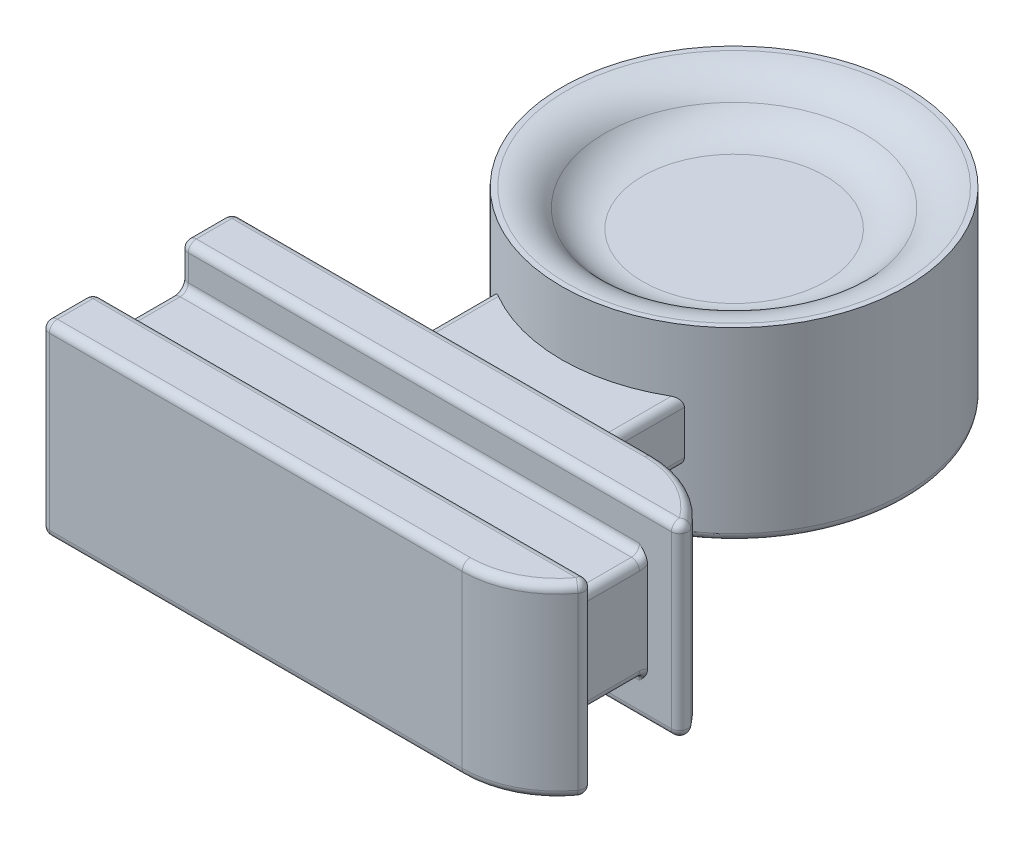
ISO-10303-21;
HEADER;
FILE_DESCRIPTION(('STEP AP214'),'2;1');
FILE_NAME('part.step','',(''),(''),'','','');
FILE_SCHEMA(('AUTOMOTIVE_DESIGN { 1 0 10303 214 1 1 1 1 }'));
ENDSEC;
DATA;
#1=APPLICATION_CONTEXT('core data for automotive mechanical design processes');
#2=APPLICATION_PROTOCOL_DEFINITION('international standard','automotive_design',2000,#1);
#3=PRODUCT_CONTEXT('',#1,'mechanical');
#4=PRODUCT('Part','Part','',(#3));
#5=PRODUCT_RELATED_PRODUCT_CATEGORY('part','',(#4));
#6=PRODUCT_DEFINITION_FORMATION('','',#4);
#7=PRODUCT_DEFINITION_CONTEXT('part definition',#1,'design');
#8=PRODUCT_DEFINITION('design','',#6,#7);
#9=PRODUCT_DEFINITION_SHAPE('','',#8);
#10=(LENGTH_UNIT() NAMED_UNIT(*) SI_UNIT(.MILLI.,.METRE.));
#11=(NAMED_UNIT(*) PLANE_ANGLE_UNIT() SI_UNIT($,.RADIAN.));
#12=(NAMED_UNIT(*) SI_UNIT($,.STERADIAN.) SOLID_ANGLE_UNIT());
#13=UNCERTAINTY_MEASURE_WITH_UNIT(LENGTH_MEASURE(1.E-05),#10,'distance_accuracy_value','');
#14=(GEOMETRIC_REPRESENTATION_CONTEXT(3) GLOBAL_UNCERTAINTY_ASSIGNED_CONTEXT((#13)) GLOBAL_UNIT_ASSIGNED_CONTEXT((#10,
#11,#12)) REPRESENTATION_CONTEXT('',''));
#15=CARTESIAN_POINT('',(0.,0.,0.));
#16=DIRECTION('',(0.,0.,1.));
#17=DIRECTION('',(1.,0.,0.));
#18=AXIS2_PLACEMENT_3D('',#15,#16,#17);
#19=CARTESIAN_POINT('',(0.,5.8674,14.4929050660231));
#20=DIRECTION('',(0.,0.,-1.));
#21=DIRECTION('',(-1.,0.,0.));
#22=AXIS2_PLACEMENT_3D('',#19,#20,#21);
#23=PLANE('',#22);
#24=DIRECTION('',(0.,1.,0.));
#25=VECTOR('',#24,1.);
#26=CARTESIAN_POINT('',(5.9436,0.,14.4929050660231));
#27=LINE('',#26,#25);
#28=CARTESIAN_POINT('',(5.9436,0.254,14.4929050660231));
#29=VERTEX_POINT('',#28);
#30=CARTESIAN_POINT('',(5.9436,5.6134,14.4929050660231));
#31=VERTEX_POINT('',#30);
#32=EDGE_CURVE('E983',#29,#31,#27,.T.);
#33=ORIENTED_EDGE('',*,*,#32,.T.);
#34=DIRECTION('',(1.,0.,0.));
#35=VECTOR('',#34,1.);
#36=CARTESIAN_POINT('',(-7.0358,5.6134,14.4929050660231));
#37=LINE('',#36,#35);
#38=CARTESIAN_POINT('',(-7.0358,5.6134,14.4929050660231));
#39=VERTEX_POINT('',#38);
#40=EDGE_CURVE('E566',#31,#39,#37,.F.);
#41=ORIENTED_EDGE('',*,*,#40,.T.);
#42=DIRECTION('',(0.,-1.,0.));
#43=VECTOR('',#42,1.);
#44=CARTESIAN_POINT('',(-7.0358,5.8674,14.4929050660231));
#45=LINE('',#44,#43);
#46=CARTESIAN_POINT('',(-7.0358,0.254,14.4929050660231));
#47=VERTEX_POINT('',#46);
#48=EDGE_CURVE('E427',#39,#47,#45,.T.);
#49=ORIENTED_EDGE('',*,*,#48,.T.);
#50=DIRECTION('',(1.,0.,0.));
#51=VECTOR('',#50,1.);
#52=CARTESIAN_POINT('',(0.,0.254,14.4929050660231));
#53=LINE('',#52,#51);
#54=EDGE_CURVE('E564',#47,#29,#53,.T.);
#55=ORIENTED_EDGE('',*,*,#54,.T.);
#56=EDGE_LOOP('',(#33,#41,#49,#55));
#57=FACE_BOUND('',#56,.T.);
#58=ADVANCED_FACE('F48',(#57),#23,.F.);
#59=CARTESIAN_POINT('',(0.,5.8674,8.49850506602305));
#60=DIRECTION('',(0.,0.,-1.));
#61=DIRECTION('',(-1.,0.,0.));
#62=AXIS2_PLACEMENT_3D('',#59,#60,#61);
#63=PLANE('',#62);
#64=DIRECTION('',(-1.,0.,0.));
#65=VECTOR('',#64,1.);
#66=CARTESIAN_POINT('',(2.9718,1.9939,8.49850506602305));
#67=LINE('',#66,#65);
#68=CARTESIAN_POINT('',(2.7178,1.9939,8.49850506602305));
#69=VERTEX_POINT('',#68);
#70=CARTESIAN_POINT('',(-2.7178,1.9939,8.49850506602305));
#71=VERTEX_POINT('',#70);
#72=EDGE_CURVE('E987',#69,#71,#67,.T.);
#73=ORIENTED_EDGE('',*,*,#72,.F.);
#74=CARTESIAN_POINT('',(2.7178,2.2479,8.49850506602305));
#75=DIRECTION('',(0.,0.,-1.));
#76=DIRECTION('',(-1.,0.,0.));
#77=AXIS2_PLACEMENT_3D('',#74,#75,#76);
#78=CIRCLE('',#77,0.254);
#79=CARTESIAN_POINT('',(2.9718,2.2479,8.49850506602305));
#80=VERTEX_POINT('',#79);
#81=EDGE_CURVE('E58',#69,#80,#78,.F.);
#82=ORIENTED_EDGE('',*,*,#81,.T.);
#83=DIRECTION('',(0.,-1.,0.));
#84=VECTOR('',#83,1.);
#85=CARTESIAN_POINT('',(2.9718,5.8674,8.49850506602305));
#86=LINE('',#85,#84);
#87=CARTESIAN_POINT('',(2.9718,3.6195,8.49850506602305));
#88=VERTEX_POINT('',#87);
#89=EDGE_CURVE('E839',#88,#80,#86,.T.);
#90=ORIENTED_EDGE('',*,*,#89,.F.);
#91=CARTESIAN_POINT('',(2.7178,3.6195,8.49850506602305));
#92=DIRECTION('',(0.,0.,-1.));
#93=DIRECTION('',(-1.,0.,0.));
#94=AXIS2_PLACEMENT_3D('',#91,#92,#93);
#95=CIRCLE('',#94,0.254);
#96=CARTESIAN_POINT('',(2.7178,3.8735,8.49850506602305));
#97=VERTEX_POINT('',#96);
#98=EDGE_CURVE('E780',#88,#97,#95,.F.);
#99=ORIENTED_EDGE('',*,*,#98,.T.);
#100=DIRECTION('',(1.,0.,0.));
#101=VECTOR('',#100,1.);
#102=CARTESIAN_POINT('',(-2.9718,3.8735,8.49850506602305));
#103=LINE('',#102,#101);
#104=CARTESIAN_POINT('',(-2.7178,3.8735,8.49850506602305));
#105=VERTEX_POINT('',#104);
#106=EDGE_CURVE('E835',#105,#97,#103,.T.);
#107=ORIENTED_EDGE('',*,*,#106,.F.);
#108=CARTESIAN_POINT('',(-2.7178,3.6195,8.49850506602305));
#109=DIRECTION('',(0.,0.,-1.));
#110=DIRECTION('',(-1.,0.,0.));
#111=AXIS2_PLACEMENT_3D('',#108,#109,#110);
#112=CIRCLE('',#111,0.254);
#113=CARTESIAN_POINT('',(-2.9718,3.6195,8.49850506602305));
#114=VERTEX_POINT('',#113);
#115=EDGE_CURVE('E818',#105,#114,#112,.F.);
#116=ORIENTED_EDGE('',*,*,#115,.T.);
#117=DIRECTION('',(0.,-1.,0.));
#118=VECTOR('',#117,1.);
#119=CARTESIAN_POINT('',(-2.9718,5.8674,8.49850506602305));
#120=LINE('',#119,#118);
#121=CARTESIAN_POINT('',(-2.9718,2.2479,8.49850506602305));
#122=VERTEX_POINT('',#121);
#123=EDGE_CURVE('E838',#114,#122,#120,.T.);
#124=ORIENTED_EDGE('',*,*,#123,.T.);
#125=CARTESIAN_POINT('',(-2.7178,2.2479,8.49850506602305));
#126=DIRECTION('',(0.,0.,-1.));
#127=DIRECTION('',(-1.,0.,0.));
#128=AXIS2_PLACEMENT_3D('',#125,#126,#127);
#129=CIRCLE('',#128,0.254);
#130=EDGE_CURVE('E813',#122,#71,#129,.F.);
#131=ORIENTED_EDGE('',*,*,#130,.T.);
#132=EDGE_LOOP('',(#73,#82,#90,#99,#107,#116,#124,#131));
#133=FACE_BOUND('',#132,.T.);
#134=DIRECTION('',(0.,-1.,0.));
#135=VECTOR('',#134,1.);
#136=CARTESIAN_POINT('',(-7.0358,5.8674,8.49850506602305));
#137=LINE('',#136,#135);
#138=CARTESIAN_POINT('',(-7.0358,0.254,8.49850506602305));
#139=VERTEX_POINT('',#138);
#140=CARTESIAN_POINT('',(-7.0358,5.6134,8.49850506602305));
#141=VERTEX_POINT('',#140);
#142=EDGE_CURVE('E394',#139,#141,#137,.F.);
#143=ORIENTED_EDGE('',*,*,#142,.T.);
#144=DIRECTION('',(1.,0.,0.));
#145=VECTOR('',#144,1.);
#146=CARTESIAN_POINT('',(0.,5.6134,8.49850506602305));
#147=LINE('',#146,#145);
#148=CARTESIAN_POINT('',(5.9436,5.6134,8.49850506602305));
#149=VERTEX_POINT('',#148);
#150=EDGE_CURVE('E562',#141,#149,#147,.T.);
#151=ORIENTED_EDGE('',*,*,#150,.T.);
#152=DIRECTION('',(0.,1.,0.));
#153=VECTOR('',#152,1.);
#154=CARTESIAN_POINT('',(5.9436,0.,8.49850506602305));
#155=LINE('',#154,#153);
#156=CARTESIAN_POINT('',(5.9436,0.254,8.49850506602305));
#157=VERTEX_POINT('',#156);
#158=EDGE_CURVE('E990',#157,#149,#155,.T.);
#159=ORIENTED_EDGE('',*,*,#158,.F.);
#160=DIRECTION('',(1.,0.,0.));
#161=VECTOR('',#160,1.);
#162=CARTESIAN_POINT('',(-7.0358,0.254,8.49850506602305));
#163=LINE('',#162,#161);
#164=EDGE_CURVE('E560',#157,#139,#163,.F.);
#165=ORIENTED_EDGE('',*,*,#164,.T.);
#166=EDGE_LOOP('',(#143,#151,#159,#165));
#167=FACE_BOUND('',#166,.T.);
#168=ADVANCED_FACE('F740',(#133,#167),#63,.T.);
#169=CARTESIAN_POINT('',(0.,0.,0.));
#170=DIRECTION('',(0.,1.,0.));
#171=DIRECTION('',(0.,0.,1.));
#172=AXIS2_PLACEMENT_3D('',#169,#170,#171);
#173=PLANE('',#172);
#174=DIRECTION('',(-1.,0.,0.));
#175=VECTOR('',#174,1.);
#176=CARTESIAN_POINT('',(0.,0.,13.1213050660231));
#177=LINE('',#176,#175);
#178=CARTESIAN_POINT('',(-7.0358,0.,13.1213050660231));
#179=VERTEX_POINT('',#178);
#180=CARTESIAN_POINT('',(8.15325401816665,0.,13.1213050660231));
#181=VERTEX_POINT('',#180);
#182=EDGE_CURVE('E430',#179,#181,#177,.F.);
#183=ORIENTED_EDGE('',*,*,#182,.T.);
#184=CARTESIAN_POINT('',(5.9436,0.,11.4957050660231));
#185=DIRECTION('',(0.,1.,0.));
#186=DIRECTION('',(0.,0.,1.));
#187=AXIS2_PLACEMENT_3D('',#184,#185,#186);
#188=CIRCLE('',#187,2.7432);
#189=CARTESIAN_POINT('',(5.9436,0.,14.2389050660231));
#190=VERTEX_POINT('',#189);
#191=EDGE_CURVE('E554',#181,#190,#188,.F.);
#192=ORIENTED_EDGE('',*,*,#191,.T.);
#193=DIRECTION('',(1.,0.,0.));
#194=VECTOR('',#193,1.);
#195=CARTESIAN_POINT('',(0.,0.,14.2389050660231));
#196=LINE('',#195,#194);
#197=CARTESIAN_POINT('',(-7.0358,0.,14.2389050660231));
#198=VERTEX_POINT('',#197);
#199=EDGE_CURVE('E552',#190,#198,#196,.F.);
#200=ORIENTED_EDGE('',*,*,#199,.T.);
#201=DIRECTION('',(0.,0.,1.));
#202=VECTOR('',#201,1.);
#203=CARTESIAN_POINT('',(-7.0358,0.,0.));
#204=LINE('',#203,#202);
#205=EDGE_CURVE('E433',#198,#179,#204,.F.);
#206=ORIENTED_EDGE('',*,*,#205,.T.);
#207=EDGE_LOOP('',(#183,#192,#200,#206));
#208=FACE_BOUND('',#207,.T.);
#209=ADVANCED_FACE('F735',(#208),#173,.F.);
#210=CARTESIAN_POINT('',(0.,5.8674,0.));
#211=DIRECTION('',(0.,1.,0.));
#212=DIRECTION('',(0.,0.,1.));
#213=AXIS2_PLACEMENT_3D('',#210,#211,#212);
#214=PLANE('',#213);
#215=DIRECTION('',(-1.,0.,0.));
#216=VECTOR('',#215,1.);
#217=CARTESIAN_POINT('',(8.60854301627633,5.8674,9.87010506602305));
#218=LINE('',#217,#216);
#219=CARTESIAN_POINT('',(-7.0358,5.8674,9.87010506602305));
#220=VERTEX_POINT('',#219);
#221=CARTESIAN_POINT('',(8.15325401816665,5.8674,9.87010506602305));
#222=VERTEX_POINT('',#221);
#223=EDGE_CURVE('E397',#220,#222,#218,.F.);
#224=ORIENTED_EDGE('',*,*,#223,.T.);
#225=CARTESIAN_POINT('',(5.9436,5.8674,11.4957050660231));
#226=DIRECTION('',(0.,1.,0.));
#227=DIRECTION('',(0.,0.,1.));
#228=AXIS2_PLACEMENT_3D('',#225,#226,#227);
#229=CIRCLE('',#228,2.7432);
#230=CARTESIAN_POINT('',(5.9436,5.8674,8.75250506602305));
#231=VERTEX_POINT('',#230);
#232=EDGE_CURVE('E558',#222,#231,#229,.T.);
#233=ORIENTED_EDGE('',*,*,#232,.T.);
#234=DIRECTION('',(1.,0.,0.));
#235=VECTOR('',#234,1.);
#236=CARTESIAN_POINT('',(0.,5.8674,8.75250506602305));
#237=LINE('',#236,#235);
#238=CARTESIAN_POINT('',(-7.0358,5.8674,8.75250506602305));
#239=VERTEX_POINT('',#238);
#240=EDGE_CURVE('E556',#231,#239,#237,.F.);
#241=ORIENTED_EDGE('',*,*,#240,.T.);
#242=DIRECTION('',(0.,0.,1.));
#243=VECTOR('',#242,1.);
#244=CARTESIAN_POINT('',(-7.0358,5.8674,10.1241050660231));
#245=LINE('',#244,#243);
#246=EDGE_CURVE('E400',#239,#220,#245,.T.);
#247=ORIENTED_EDGE('',*,*,#246,.T.);
#248=EDGE_LOOP('',(#224,#233,#241,#247));
#249=FACE_BOUND('',#248,.T.);
#250=ADVANCED_FACE('F730',(#249),#214,.T.);
#251=CARTESIAN_POINT('',(-2.9718,5.8674,0.));
#252=DIRECTION('',(1.,0.,0.));
#253=DIRECTION('',(0.,0.,-1.));
#254=AXIS2_PLACEMENT_3D('',#251,#252,#253);
#255=PLANE('',#254);
#256=DIRECTION('',(0.,-1.,0.));
#257=VECTOR('',#256,1.);
#258=CARTESIAN_POINT('',(-2.9718,5.8674,4.53610506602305));
#259=LINE('',#258,#257);
#260=CARTESIAN_POINT('',(-2.9718,3.6195,4.53610506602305));
#261=VERTEX_POINT('',#260);
#262=CARTESIAN_POINT('',(-2.9718,2.2479,4.53610506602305));
#263=VERTEX_POINT('',#262);
#264=EDGE_CURVE('E829',#261,#263,#259,.T.);
#265=ORIENTED_EDGE('',*,*,#264,.T.);
#266=DIRECTION('',(0.,0.,-1.));
#267=VECTOR('',#266,1.);
#268=CARTESIAN_POINT('',(-2.9718,2.2479,8.49850506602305));
#269=LINE('',#268,#267);
#270=EDGE_CURVE('E638',#263,#122,#269,.F.);
#271=ORIENTED_EDGE('',*,*,#270,.T.);
#272=ORIENTED_EDGE('',*,*,#123,.F.);
#273=DIRECTION('',(0.,0.,1.));
#274=VECTOR('',#273,1.);
#275=CARTESIAN_POINT('',(-2.9718,3.6195,4.53610506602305));
#276=LINE('',#275,#274);
#277=EDGE_CURVE('E636',#114,#261,#276,.F.);
#278=ORIENTED_EDGE('',*,*,#277,.T.);
#279=EDGE_LOOP('',(#265,#271,#272,#278));
#280=FACE_BOUND('',#279,.T.);
#281=ADVANCED_FACE('F739',(#280),#255,.F.);
#282=CARTESIAN_POINT('',(2.9718,5.8674,0.));
#283=DIRECTION('',(1.,0.,0.));
#284=DIRECTION('',(0.,0.,-1.));
#285=AXIS2_PLACEMENT_3D('',#282,#283,#284);
#286=PLANE('',#285);
#287=DIRECTION('',(0.,-1.,0.));
#288=VECTOR('',#287,1.);
#289=CARTESIAN_POINT('',(2.9718,5.8674,4.53610506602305));
#290=LINE('',#289,#288);
#291=CARTESIAN_POINT('',(2.9718,3.6195,4.53610506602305));
#292=VERTEX_POINT('',#291);
#293=CARTESIAN_POINT('',(2.9718,2.2479,4.53610506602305));
#294=VERTEX_POINT('',#293);
#295=EDGE_CURVE('E843',#292,#294,#290,.T.);
#296=ORIENTED_EDGE('',*,*,#295,.F.);
#297=DIRECTION('',(0.,0.,-1.));
#298=VECTOR('',#297,1.);
#299=CARTESIAN_POINT('',(2.9718,3.6195,0.));
#300=LINE('',#299,#298);
#301=EDGE_CURVE('E72',#292,#88,#300,.F.);
#302=ORIENTED_EDGE('',*,*,#301,.T.);
#303=ORIENTED_EDGE('',*,*,#89,.T.);
#304=DIRECTION('',(0.,0.,1.));
#305=VECTOR('',#304,1.);
#306=CARTESIAN_POINT('',(2.9718,2.2479,0.));
#307=LINE('',#306,#305);
#308=EDGE_CURVE('E646',#80,#294,#307,.F.);
#309=ORIENTED_EDGE('',*,*,#308,.T.);
#310=EDGE_LOOP('',(#296,#302,#303,#309));
#311=FACE_BOUND('',#310,.T.);
#312=ADVANCED_FACE('F736',(#311),#286,.T.);
#313=CARTESIAN_POINT('',(0.,5.8674,0.));
#314=DIRECTION('',(0.,1.,0.));
#315=DIRECTION('',(0.,0.,1.));
#316=AXIS2_PLACEMENT_3D('',#313,#314,#315);
#317=CIRCLE('',#316,5.25429679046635);
#318=CARTESIAN_POINT('',(0.,5.8674,5.25429679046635));
#319=VERTEX_POINT('',#318);
#320=EDGE_CURVE('E841',#319,#319,#317,.F.);
#321=ORIENTED_EDGE('',*,*,#320,.T.);
#322=EDGE_LOOP('',(#321));
#323=FACE_BOUND('',#322,.T.);
#324=CARTESIAN_POINT('',(0.,5.8674,0.));
#325=DIRECTION('',(0.,1.,0.));
#326=DIRECTION('',(0.,0.,1.));
#327=AXIS2_PLACEMENT_3D('',#324,#325,#326);
#328=CIRCLE('',#327,5.4229);
#329=CARTESIAN_POINT('',(0.,5.8674,5.4229));
#330=VERTEX_POINT('',#329);
#331=EDGE_CURVE('E834',#330,#330,#328,.T.);
#332=ORIENTED_EDGE('',*,*,#331,.T.);
#333=EDGE_LOOP('',(#332));
#334=FACE_BOUND('',#333,.T.);
#335=ADVANCED_FACE('F731',(#323,#334),#214,.T.);
#336=CARTESIAN_POINT('',(0.,5.8674,0.));
#337=DIRECTION('',(0.,-1.,0.));
#338=DIRECTION('',(0.,0.,-1.));
#339=AXIS2_PLACEMENT_3D('',#336,#337,#338);
#340=CYLINDRICAL_SURFACE('',#339,5.4229);
#341=CARTESIAN_POINT('',(0.,0.259373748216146,0.));
#342=DIRECTION('',(0.,-1.,0.));
#343=DIRECTION('',(0.,0.,-1.));
#344=AXIS2_PLACEMENT_3D('',#341,#342,#343);
#345=CIRCLE('',#344,5.4229);
#346=CARTESIAN_POINT('',(0.,0.259373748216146,-5.4229));
#347=VERTEX_POINT('',#346);
#348=EDGE_CURVE('E624',#347,#347,#345,.F.);
#349=ORIENTED_EDGE('',*,*,#348,.T.);
#350=EDGE_LOOP('',(#349));
#351=FACE_BOUND('',#350,.T.);
#352=ORIENTED_EDGE('',*,*,#264,.F.);
#353=CARTESIAN_POINT('',(-2.9718,3.6195,4.53610506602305));
#354=CARTESIAN_POINT('',(-2.97181745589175,3.6321792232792,4.53609208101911));
#355=CARTESIAN_POINT('',(-2.97085190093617,3.64484009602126,4.53672622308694));
#356=CARTESIAN_POINT('',(-2.96709959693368,3.66970461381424,4.53918197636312));
#357=CARTESIAN_POINT('',(-2.96432249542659,3.68191032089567,4.54099729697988));
#358=CARTESIAN_POINT('',(-2.95709396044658,3.70556987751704,4.54570754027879));
#359=CARTESIAN_POINT('',(-2.95264472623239,3.71702469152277,4.548601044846));
#360=CARTESIAN_POINT('',(-2.94227973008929,3.73896619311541,4.55531258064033));
#361=CARTESIAN_POINT('',(-2.93636229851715,3.74945175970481,4.55913166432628));
#362=CARTESIAN_POINT('',(-2.92286014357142,3.769920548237,4.56780047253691));
#363=CARTESIAN_POINT('',(-2.91519209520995,3.77982691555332,4.57270102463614));
#364=CARTESIAN_POINT('',(-2.89870700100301,3.79822144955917,4.58316894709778));
#365=CARTESIAN_POINT('',(-2.88988969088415,3.80670928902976,4.58873647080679));
#366=CARTESIAN_POINT('',(-2.86988561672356,3.82341461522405,4.60127815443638));
#367=CARTESIAN_POINT('',(-2.85854379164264,3.83138339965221,4.60833626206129));
#368=CARTESIAN_POINT('',(-2.83493237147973,3.84529671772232,4.62289912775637));
#369=CARTESIAN_POINT('',(-2.82266172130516,3.85123890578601,4.630404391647));
#370=CARTESIAN_POINT('',(-2.79530059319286,3.86190596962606,4.64698115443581));
#371=CARTESIAN_POINT('',(-2.78008802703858,3.86624588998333,4.65610007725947));
#372=CARTESIAN_POINT('',(-2.74919708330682,3.87204070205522,4.67440814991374));
#373=CARTESIAN_POINT('',(-2.73351949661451,3.87350023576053,4.68359716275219));
#374=CARTESIAN_POINT('',(-2.7178,3.8735,4.69269725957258));
#375=B_SPLINE_CURVE_WITH_KNOTS('',3,(#353,#354,#355,#356,#357,#358,#359,#360,#361,#362,#363,
#364,#365,#366,#367,#368,#369,#370,#371,#372,#373,#374),.UNSPECIFIED.,.F.,.F.,(4,2,2,2,2,2,2,2,
2,2,4),(0.,0.0379562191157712,0.0757119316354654,0.113418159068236,0.151167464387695,
0.191368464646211,0.231578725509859,0.2780613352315,0.324597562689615,0.379134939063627,
0.433584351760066),.UNSPECIFIED.);
#376=CARTESIAN_POINT('',(-2.7178,3.8735,4.69269725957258));
#377=VERTEX_POINT('',#376);
#378=EDGE_CURVE('E768',#261,#377,#375,.T.);
#379=ORIENTED_EDGE('',*,*,#378,.T.);
#380=CARTESIAN_POINT('',(0.,3.8735,0.));
#381=DIRECTION('',(0.,-1.,0.));
#382=DIRECTION('',(0.,0.,1.));
#383=AXIS2_PLACEMENT_3D('',#380,#381,#382);
#384=CIRCLE('',#383,5.4229);
#385=CARTESIAN_POINT('',(2.7178,3.8735,4.69269725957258));
#386=VERTEX_POINT('',#385);
#387=EDGE_CURVE('E828',#386,#377,#384,.T.);
#388=ORIENTED_EDGE('',*,*,#387,.F.);
#389=CARTESIAN_POINT('',(2.7178,3.8735,4.69269725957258));
#390=CARTESIAN_POINT('',(2.73651235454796,3.8735008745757,4.68186782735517));
#391=CARTESIAN_POINT('',(2.7551704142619,3.87143184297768,4.67090481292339));
#392=CARTESIAN_POINT('',(2.79179237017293,3.8632115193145,4.64910491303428));
#393=CARTESIAN_POINT('',(2.80975158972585,3.8570365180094,4.63826913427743));
#394=CARTESIAN_POINT('',(2.84201423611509,3.84168285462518,4.61856215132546));
#395=CARTESIAN_POINT('',(2.85649442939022,3.83297390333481,4.60961432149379));
#396=CARTESIAN_POINT('',(2.8837254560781,3.81256113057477,4.59262743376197));
#397=CARTESIAN_POINT('',(2.89648217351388,3.80086791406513,4.5845853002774));
#398=CARTESIAN_POINT('',(2.91667967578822,3.7780307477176,4.57175341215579));
#399=CARTESIAN_POINT('',(2.92464401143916,3.76751829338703,4.56665902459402));
#400=CARTESIAN_POINT('',(2.93899320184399,3.74506559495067,4.55743743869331));
#401=CARTESIAN_POINT('',(2.94537784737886,3.73312516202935,4.55331036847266));
#402=CARTESIAN_POINT('',(2.95628734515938,3.70798185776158,4.54623498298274));
#403=CARTESIAN_POINT('',(2.96079834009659,3.69477044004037,4.54329545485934));
#404=CARTESIAN_POINT('',(2.96760056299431,3.66757155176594,4.5388553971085));
#405=CARTESIAN_POINT('',(2.96989777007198,3.65358628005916,4.53735099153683));
#406=CARTESIAN_POINT('',(2.97127466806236,3.63616951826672,4.53644918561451));
#407=CARTESIAN_POINT('',(2.97147168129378,3.63283769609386,4.53632014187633));
#408=CARTESIAN_POINT('',(2.97173411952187,3.62617108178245,4.53614823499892));
#409=CARTESIAN_POINT('',(2.9717997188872,3.62283629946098,4.53610525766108));
#410=CARTESIAN_POINT('',(2.9718,3.6195,4.53610506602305));
#411=B_SPLINE_CURVE_WITH_KNOTS('',3,(#389,#390,#391,#392,#393,#394,#395,#396,#397,#398,#399,
#400,#401,#402,#403,#404,#405,#406,#407,#408,#409,#410),.UNSPECIFIED.,.F.,.F.,(4,2,2,2,2,2,2,2,
2,2,4),(0.,0.0648015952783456,0.129980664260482,0.187044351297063,0.243908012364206,
0.286154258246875,0.328406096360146,0.370965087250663,0.413408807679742,0.423427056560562,
0.433432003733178),.UNSPECIFIED.);
#412=EDGE_CURVE('E775',#386,#292,#411,.T.);
#413=ORIENTED_EDGE('',*,*,#412,.T.);
#414=ORIENTED_EDGE('',*,*,#295,.T.);
#415=CARTESIAN_POINT('',(2.9718,2.2479,4.53610506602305));
#416=CARTESIAN_POINT('',(2.97181745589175,2.2352207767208,4.53609208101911));
#417=CARTESIAN_POINT('',(2.97085190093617,2.22255990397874,4.53672622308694));
#418=CARTESIAN_POINT('',(2.96709959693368,2.19769538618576,4.53918197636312));
#419=CARTESIAN_POINT('',(2.96432249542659,2.18548967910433,4.54099729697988));
#420=CARTESIAN_POINT('',(2.95709396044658,2.16183012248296,4.54570754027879));
#421=CARTESIAN_POINT('',(2.95264472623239,2.15037530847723,4.548601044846));
#422=CARTESIAN_POINT('',(2.94227973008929,2.12843380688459,4.55531258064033));
#423=CARTESIAN_POINT('',(2.93636229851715,2.11794824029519,4.55913166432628));
#424=CARTESIAN_POINT('',(2.92286014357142,2.097479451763,4.56780047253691));
#425=CARTESIAN_POINT('',(2.91519209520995,2.08757308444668,4.57270102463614));
#426=CARTESIAN_POINT('',(2.89870700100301,2.06917855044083,4.58316894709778));
#427=CARTESIAN_POINT('',(2.88988969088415,2.06069071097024,4.58873647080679));
#428=CARTESIAN_POINT('',(2.86988561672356,2.04398538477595,4.60127815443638));
#429=CARTESIAN_POINT('',(2.85854379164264,2.03601660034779,4.60833626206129));
#430=CARTESIAN_POINT('',(2.83493237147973,2.02210328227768,4.62289912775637));
#431=CARTESIAN_POINT('',(2.82266172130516,2.01616109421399,4.630404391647));
#432=CARTESIAN_POINT('',(2.79530059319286,2.00549403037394,4.64698115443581));
#433=CARTESIAN_POINT('',(2.78008802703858,2.00115411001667,4.65610007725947));
#434=CARTESIAN_POINT('',(2.74919708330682,1.99535929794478,4.67440814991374));
#435=CARTESIAN_POINT('',(2.73351949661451,1.99389976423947,4.68359716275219));
#436=CARTESIAN_POINT('',(2.7178,1.9939,4.69269725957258));
#437=B_SPLINE_CURVE_WITH_KNOTS('',3,(#415,#416,#417,#418,#419,#420,#421,#422,#423,#424,#425,
#426,#427,#428,#429,#430,#431,#432,#433,#434,#435,#436),.UNSPECIFIED.,.F.,.F.,(4,2,2,2,2,2,2,2,
2,2,4),(0.,0.0379562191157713,0.0757119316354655,0.113418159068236,0.151167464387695,
0.191368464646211,0.231578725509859,0.2780613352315,0.324597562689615,0.379134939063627,
0.433584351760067),.UNSPECIFIED.);
#438=CARTESIAN_POINT('',(2.7178,1.9939,4.69269725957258));
#439=VERTEX_POINT('',#438);
#440=EDGE_CURVE('E13',#294,#439,#437,.T.);
#441=ORIENTED_EDGE('',*,*,#440,.T.);
#442=CARTESIAN_POINT('',(0.,1.9939,0.));
#443=DIRECTION('',(0.,1.,0.));
#444=DIRECTION('',(0.,0.,-1.));
#445=AXIS2_PLACEMENT_3D('',#442,#443,#444);
#446=CIRCLE('',#445,5.4229);
#447=CARTESIAN_POINT('',(-2.7178,1.9939,4.69269725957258));
#448=VERTEX_POINT('',#447);
#449=EDGE_CURVE('E989',#448,#439,#446,.T.);
#450=ORIENTED_EDGE('',*,*,#449,.F.);
#451=CARTESIAN_POINT('',(-2.7178,1.9939,4.69269725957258));
#452=CARTESIAN_POINT('',(-2.73651235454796,1.9938991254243,4.68186782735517));
#453=CARTESIAN_POINT('',(-2.7551704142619,1.99596815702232,4.67090481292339));
#454=CARTESIAN_POINT('',(-2.79179237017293,2.0041884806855,4.64910491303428));
#455=CARTESIAN_POINT('',(-2.80975158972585,2.0103634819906,4.63826913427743));
#456=CARTESIAN_POINT('',(-2.84201423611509,2.02571714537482,4.61856215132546));
#457=CARTESIAN_POINT('',(-2.85649442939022,2.03442609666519,4.60961432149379));
#458=CARTESIAN_POINT('',(-2.8837254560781,2.05483886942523,4.59262743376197));
#459=CARTESIAN_POINT('',(-2.89648217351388,2.06653208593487,4.5845853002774));
#460=CARTESIAN_POINT('',(-2.91667967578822,2.0893692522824,4.57175341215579));
#461=CARTESIAN_POINT('',(-2.92464401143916,2.09988170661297,4.56665902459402));
#462=CARTESIAN_POINT('',(-2.93899320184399,2.12233440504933,4.55743743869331));
#463=CARTESIAN_POINT('',(-2.94537784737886,2.13427483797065,4.55331036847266));
#464=CARTESIAN_POINT('',(-2.95628734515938,2.15941814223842,4.54623498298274));
#465=CARTESIAN_POINT('',(-2.96079834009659,2.17262955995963,4.54329545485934));
#466=CARTESIAN_POINT('',(-2.96760056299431,2.19982844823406,4.5388553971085));
#467=CARTESIAN_POINT('',(-2.96989777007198,2.21381371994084,4.53735099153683));
#468=CARTESIAN_POINT('',(-2.97127466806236,2.23123048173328,4.53644918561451));
#469=CARTESIAN_POINT('',(-2.97147168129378,2.23456230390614,4.53632014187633));
#470=CARTESIAN_POINT('',(-2.97173411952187,2.24122891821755,4.53614823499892));
#471=CARTESIAN_POINT('',(-2.9717997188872,2.24456370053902,4.53610525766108));
#472=CARTESIAN_POINT('',(-2.9718,2.2479,4.53610506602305));
#473=B_SPLINE_CURVE_WITH_KNOTS('',3,(#451,#452,#453,#454,#455,#456,#457,#458,#459,#460,#461,
#462,#463,#464,#465,#466,#467,#468,#469,#470,#471,#472),.UNSPECIFIED.,.F.,.F.,(4,2,2,2,2,2,2,2,
2,2,4),(0.,0.0648015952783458,0.129980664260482,0.187044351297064,0.243908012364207,
0.286154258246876,0.328406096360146,0.370965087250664,0.413408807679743,0.423427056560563,
0.433432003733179),.UNSPECIFIED.);
#474=EDGE_CURVE('E760',#448,#263,#473,.T.);
#475=ORIENTED_EDGE('',*,*,#474,.T.);
#476=EDGE_LOOP('',(#352,#379,#388,#413,#414,#441,#450,#475));
#477=FACE_BOUND('',#476,.T.);
#478=ORIENTED_EDGE('',*,*,#331,.F.);
#479=EDGE_LOOP('',(#478));
#480=FACE_BOUND('',#479,.T.);
#481=ADVANCED_FACE('F748',(#351,#477,#480),#340,.T.);
#482=CARTESIAN_POINT('',(-7.2898,5.8674,0.));
#483=DIRECTION('',(1.,0.,0.));
#484=DIRECTION('',(0.,0.,-1.));
#485=AXIS2_PLACEMENT_3D('',#482,#483,#484);
#486=PLANE('',#485);
#487=DIRECTION('',(0.,-1.,0.));
#488=VECTOR('',#487,1.);
#489=CARTESIAN_POINT('',(-7.2898,5.8674,9.87010506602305));
#490=LINE('',#489,#488);
#491=CARTESIAN_POINT('',(-7.2898,0.254,9.87010506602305));
#492=VERTEX_POINT('',#491);
#493=CARTESIAN_POINT('',(-7.2898,1.0668,9.87010506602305));
#494=VERTEX_POINT('',#493);
#495=EDGE_CURVE('E369',#492,#494,#490,.F.);
#496=ORIENTED_EDGE('',*,*,#495,.T.);
#497=CARTESIAN_POINT('',(-7.2898,1.0668,10.3781050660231));
#498=DIRECTION('',(1.,0.,0.));
#499=DIRECTION('',(0.,0.,-1.));
#500=AXIS2_PLACEMENT_3D('',#497,#498,#499);
#501=CIRCLE('',#500,0.508);
#502=CARTESIAN_POINT('',(-7.2898,1.5748,10.3781050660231));
#503=VERTEX_POINT('',#502);
#504=EDGE_CURVE('E349',#494,#503,#501,.T.);
#505=ORIENTED_EDGE('',*,*,#504,.T.);
#506=DIRECTION('',(0.,0.,-1.));
#507=VECTOR('',#506,1.);
#508=CARTESIAN_POINT('',(-7.2898,1.5748,0.));
#509=LINE('',#508,#507);
#510=CARTESIAN_POINT('',(-7.2898,1.5748,12.6133050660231));
#511=VERTEX_POINT('',#510);
#512=EDGE_CURVE('E358',#503,#511,#509,.F.);
#513=ORIENTED_EDGE('',*,*,#512,.T.);
#514=CARTESIAN_POINT('',(-7.2898,1.0668,12.6133050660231));
#515=DIRECTION('',(1.,0.,0.));
#516=DIRECTION('',(0.,0.,-1.));
#517=AXIS2_PLACEMENT_3D('',#514,#515,#516);
#518=CIRCLE('',#517,0.508);
#519=CARTESIAN_POINT('',(-7.2898,1.0668,13.1213050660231));
#520=VERTEX_POINT('',#519);
#521=EDGE_CURVE('E364',#511,#520,#518,.T.);
#522=ORIENTED_EDGE('',*,*,#521,.T.);
#523=DIRECTION('',(0.,1.,0.));
#524=VECTOR('',#523,1.);
#525=CARTESIAN_POINT('',(-7.2898,5.8674,13.1213050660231));
#526=LINE('',#525,#524);
#527=CARTESIAN_POINT('',(-7.2898,0.254,13.1213050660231));
#528=VERTEX_POINT('',#527);
#529=EDGE_CURVE('E880',#520,#528,#526,.F.);
#530=ORIENTED_EDGE('',*,*,#529,.T.);
#531=DIRECTION('',(0.,0.,1.));
#532=VECTOR('',#531,1.);
#533=CARTESIAN_POINT('',(-7.2898,0.254,0.));
#534=LINE('',#533,#532);
#535=CARTESIAN_POINT('',(-7.2898,0.254,14.2389050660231));
#536=VERTEX_POINT('',#535);
#537=EDGE_CURVE('E882',#528,#536,#534,.T.);
#538=ORIENTED_EDGE('',*,*,#537,.T.);
#539=DIRECTION('',(0.,-1.,0.));
#540=VECTOR('',#539,1.);
#541=CARTESIAN_POINT('',(-7.2898,5.8674,14.2389050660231));
#542=LINE('',#541,#540);
#543=CARTESIAN_POINT('',(-7.2898,5.6134,14.2389050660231));
#544=VERTEX_POINT('',#543);
#545=EDGE_CURVE('E885',#536,#544,#542,.F.);
#546=ORIENTED_EDGE('',*,*,#545,.T.);
#547=DIRECTION('',(0.,0.,1.));
#548=VECTOR('',#547,1.);
#549=CARTESIAN_POINT('',(-7.2898,5.6134,12.8673050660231));
#550=LINE('',#549,#548);
#551=CARTESIAN_POINT('',(-7.2898,5.6134,13.1213050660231));
#552=VERTEX_POINT('',#551);
#553=EDGE_CURVE('E888',#544,#552,#550,.F.);
#554=ORIENTED_EDGE('',*,*,#553,.T.);
#555=DIRECTION('',(0.,1.,0.));
#556=VECTOR('',#555,1.);
#557=CARTESIAN_POINT('',(-7.2898,5.8674,13.1213050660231));
#558=LINE('',#557,#556);
#559=CARTESIAN_POINT('',(-7.2898,4.8006,13.1213050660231));
#560=VERTEX_POINT('',#559);
#561=EDGE_CURVE('E890',#552,#560,#558,.F.);
#562=ORIENTED_EDGE('',*,*,#561,.T.);
#563=CARTESIAN_POINT('',(-7.2898,4.8006,12.6133050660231));
#564=DIRECTION('',(1.,0.,0.));
#565=DIRECTION('',(0.,0.,-1.));
#566=AXIS2_PLACEMENT_3D('',#563,#564,#565);
#567=CIRCLE('',#566,0.508);
#568=CARTESIAN_POINT('',(-7.2898,4.2926,12.6133050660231));
#569=VERTEX_POINT('',#568);
#570=EDGE_CURVE('E892',#560,#569,#567,.T.);
#571=ORIENTED_EDGE('',*,*,#570,.T.);
#572=DIRECTION('',(0.,0.,1.));
#573=VECTOR('',#572,1.);
#574=CARTESIAN_POINT('',(-7.2898,4.2926,0.));
#575=LINE('',#574,#573);
#576=CARTESIAN_POINT('',(-7.2898,4.2926,10.3781050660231));
#577=VERTEX_POINT('',#576);
#578=EDGE_CURVE('E894',#569,#577,#575,.F.);
#579=ORIENTED_EDGE('',*,*,#578,.T.);
#580=CARTESIAN_POINT('',(-7.2898,4.8006,10.3781050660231));
#581=DIRECTION('',(1.,0.,0.));
#582=DIRECTION('',(0.,0.,-1.));
#583=AXIS2_PLACEMENT_3D('',#580,#581,#582);
#584=CIRCLE('',#583,0.508);
#585=CARTESIAN_POINT('',(-7.2898,4.8006,9.87010506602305));
#586=VERTEX_POINT('',#585);
#587=EDGE_CURVE('E896',#577,#586,#584,.T.);
#588=ORIENTED_EDGE('',*,*,#587,.T.);
#589=DIRECTION('',(0.,-1.,0.));
#590=VECTOR('',#589,1.);
#591=CARTESIAN_POINT('',(-7.2898,5.8674,9.87010506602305));
#592=LINE('',#591,#590);
#593=CARTESIAN_POINT('',(-7.2898,5.6134,9.87010506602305));
#594=VERTEX_POINT('',#593);
#595=EDGE_CURVE('E898',#586,#594,#592,.F.);
#596=ORIENTED_EDGE('',*,*,#595,.T.);
#597=DIRECTION('',(0.,0.,1.));
#598=VECTOR('',#597,1.);
#599=CARTESIAN_POINT('',(-7.2898,5.6134,8.49850506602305));
#600=LINE('',#599,#598);
#601=CARTESIAN_POINT('',(-7.2898,5.6134,8.75250506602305));
#602=VERTEX_POINT('',#601);
#603=EDGE_CURVE('E900',#594,#602,#600,.F.);
#604=ORIENTED_EDGE('',*,*,#603,.T.);
#605=DIRECTION('',(0.,-1.,0.));
#606=VECTOR('',#605,1.);
#607=CARTESIAN_POINT('',(-7.2898,0.,8.75250506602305));
#608=LINE('',#607,#606);
#609=CARTESIAN_POINT('',(-7.2898,0.254,8.75250506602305));
#610=VERTEX_POINT('',#609);
#611=EDGE_CURVE('E903',#602,#610,#608,.T.);
#612=ORIENTED_EDGE('',*,*,#611,.T.);
#613=DIRECTION('',(0.,0.,1.));
#614=VECTOR('',#613,1.);
#615=CARTESIAN_POINT('',(-7.2898,0.254,0.));
#616=LINE('',#615,#614);
#617=EDGE_CURVE('E374',#610,#492,#616,.T.);
#618=ORIENTED_EDGE('',*,*,#617,.T.);
#619=EDGE_LOOP('',(#496,#505,#513,#522,#530,#538,#546,#554,#562,#571,#579,#588,#596,#604,#612,#618));
#620=FACE_BOUND('',#619,.T.);
#621=ADVANCED_FACE('F367',(#620),#486,.F.);
#622=DIRECTION('',(1.,0.,0.));
#623=VECTOR('',#622,1.);
#624=CARTESIAN_POINT('',(5.9436,5.8674,14.2389050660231));
#625=LINE('',#624,#623);
#626=CARTESIAN_POINT('',(-7.0358,5.8674,14.2389050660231));
#627=VERTEX_POINT('',#626);
#628=CARTESIAN_POINT('',(5.9436,5.8674,14.2389050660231));
#629=VERTEX_POINT('',#628);
#630=EDGE_CURVE('E543',#627,#629,#625,.T.);
#631=ORIENTED_EDGE('',*,*,#630,.T.);
#632=CARTESIAN_POINT('',(5.9436,5.8674,11.4957050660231));
#633=DIRECTION('',(0.,1.,0.));
#634=DIRECTION('',(0.,0.,1.));
#635=AXIS2_PLACEMENT_3D('',#632,#633,#634);
#636=CIRCLE('',#635,2.7432);
#637=CARTESIAN_POINT('',(8.15325401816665,5.8674,13.1213050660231));
#638=VERTEX_POINT('',#637);
#639=EDGE_CURVE('E545',#629,#638,#636,.T.);
#640=ORIENTED_EDGE('',*,*,#639,.T.);
#641=DIRECTION('',(-1.,0.,0.));
#642=VECTOR('',#641,1.);
#643=CARTESIAN_POINT('',(-7.2898,5.8674,13.1213050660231));
#644=LINE('',#643,#642);
#645=CARTESIAN_POINT('',(-7.0358,5.8674,13.1213050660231));
#646=VERTEX_POINT('',#645);
#647=EDGE_CURVE('E422',#638,#646,#644,.T.);
#648=ORIENTED_EDGE('',*,*,#647,.T.);
#649=DIRECTION('',(0.,0.,1.));
#650=VECTOR('',#649,1.);
#651=CARTESIAN_POINT('',(-7.0358,5.8674,14.4929050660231));
#652=LINE('',#651,#650);
#653=EDGE_CURVE('E424',#646,#627,#652,.T.);
#654=ORIENTED_EDGE('',*,*,#653,.T.);
#655=EDGE_LOOP('',(#631,#640,#648,#654));
#656=FACE_BOUND('',#655,.T.);
#657=ADVANCED_FACE('F726',(#656),#214,.T.);
#658=DIRECTION('',(1.,0.,0.));
#659=VECTOR('',#658,1.);
#660=CARTESIAN_POINT('',(5.9436,0.,8.75250506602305));
#661=LINE('',#660,#659);
#662=CARTESIAN_POINT('',(-7.0358,0.,8.75250506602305));
#663=VERTEX_POINT('',#662);
#664=CARTESIAN_POINT('',(5.9436,0.,8.75250506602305));
#665=VERTEX_POINT('',#664);
#666=EDGE_CURVE('E518',#663,#665,#661,.T.);
#667=ORIENTED_EDGE('',*,*,#666,.T.);
#668=CARTESIAN_POINT('',(5.9436,0.,11.4957050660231));
#669=DIRECTION('',(0.,1.,0.));
#670=DIRECTION('',(0.,0.,1.));
#671=AXIS2_PLACEMENT_3D('',#668,#669,#670);
#672=CIRCLE('',#671,2.7432);
#673=CARTESIAN_POINT('',(8.15325401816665,0.,9.87010506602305));
#674=VERTEX_POINT('',#673);
#675=EDGE_CURVE('E520',#665,#674,#672,.F.);
#676=ORIENTED_EDGE('',*,*,#675,.T.);
#677=DIRECTION('',(-1.,0.,0.));
#678=VECTOR('',#677,1.);
#679=CARTESIAN_POINT('',(0.,0.,9.87010506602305));
#680=LINE('',#679,#678);
#681=CARTESIAN_POINT('',(-7.0358,0.,9.87010506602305));
#682=VERTEX_POINT('',#681);
#683=EDGE_CURVE('E389',#674,#682,#680,.T.);
#684=ORIENTED_EDGE('',*,*,#683,.T.);
#685=DIRECTION('',(0.,0.,1.));
#686=VECTOR('',#685,1.);
#687=CARTESIAN_POINT('',(-7.0358,0.,0.));
#688=LINE('',#687,#686);
#689=EDGE_CURVE('E391',#682,#663,#688,.F.);
#690=ORIENTED_EDGE('',*,*,#689,.T.);
#691=EDGE_LOOP('',(#667,#676,#684,#690));
#692=FACE_BOUND('',#691,.T.);
#693=ADVANCED_FACE('F724',(#692),#173,.F.);
#694=CARTESIAN_POINT('',(0.,3.8735,0.));
#695=DIRECTION('',(0.,1.,0.));
#696=DIRECTION('',(0.,0.,1.));
#697=AXIS2_PLACEMENT_3D('',#694,#695,#696);
#698=PLANE('',#697);
#699=ORIENTED_EDGE('',*,*,#387,.T.);
#700=DIRECTION('',(0.,0.,1.));
#701=VECTOR('',#700,1.);
#702=CARTESIAN_POINT('',(-2.7178,3.8735,8.49850506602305));
#703=LINE('',#702,#701);
#704=EDGE_CURVE('E643',#377,#105,#703,.T.);
#705=ORIENTED_EDGE('',*,*,#704,.T.);
#706=ORIENTED_EDGE('',*,*,#106,.T.);
#707=DIRECTION('',(0.,0.,-1.));
#708=VECTOR('',#707,1.);
#709=CARTESIAN_POINT('',(2.7178,3.8735,0.));
#710=LINE('',#709,#708);
#711=EDGE_CURVE('E640',#97,#386,#710,.T.);
#712=ORIENTED_EDGE('',*,*,#711,.T.);
#713=EDGE_LOOP('',(#699,#705,#706,#712));
#714=FACE_BOUND('',#713,.T.);
#715=ADVANCED_FACE('F720',(#714),#698,.T.);
#716=CARTESIAN_POINT('',(0.,1.9939,0.));
#717=DIRECTION('',(0.,-1.,0.));
#718=DIRECTION('',(0.,0.,-1.));
#719=AXIS2_PLACEMENT_3D('',#716,#717,#718);
#720=PLANE('',#719);
#721=ORIENTED_EDGE('',*,*,#72,.T.);
#722=DIRECTION('',(0.,0.,-1.));
#723=VECTOR('',#722,1.);
#724=CARTESIAN_POINT('',(-2.7178,1.9939,4.53610506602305));
#725=LINE('',#724,#723);
#726=EDGE_CURVE('E633',#71,#448,#725,.T.);
#727=ORIENTED_EDGE('',*,*,#726,.T.);
#728=ORIENTED_EDGE('',*,*,#449,.T.);
#729=DIRECTION('',(0.,0.,1.));
#730=VECTOR('',#729,1.);
#731=CARTESIAN_POINT('',(2.7178,1.9939,0.));
#732=LINE('',#731,#730);
#733=EDGE_CURVE('E630',#439,#69,#732,.T.);
#734=ORIENTED_EDGE('',*,*,#733,.T.);
#735=EDGE_LOOP('',(#721,#727,#728,#734));
#736=FACE_BOUND('',#735,.T.);
#737=ADVANCED_FACE('F716',(#736),#720,.T.);
#738=CARTESIAN_POINT('',(8.9408,4.5466,0.));
#739=DIRECTION('',(0.,-1.,0.));
#740=DIRECTION('',(0.,0.,-1.));
#741=AXIS2_PLACEMENT_3D('',#738,#739,#740);
#742=PLANE('',#741);
#743=DIRECTION('',(-1.,0.,0.));
#744=VECTOR('',#743,1.);
#745=CARTESIAN_POINT('',(7.40195167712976,4.5466,12.6133050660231));
#746=LINE('',#745,#744);
#747=CARTESIAN_POINT('',(-7.0358,4.5466,12.6133050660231));
#748=VERTEX_POINT('',#747);
#749=CARTESIAN_POINT('',(7.14795167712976,4.5466,12.6133050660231));
#750=VERTEX_POINT('',#749);
#751=EDGE_CURVE('E365',#748,#750,#746,.F.);
#752=ORIENTED_EDGE('',*,*,#751,.T.);
#753=DIRECTION('',(0.,0.,-1.));
#754=VECTOR('',#753,1.);
#755=CARTESIAN_POINT('',(7.14795167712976,4.5466,0.));
#756=LINE('',#755,#754);
#757=CARTESIAN_POINT('',(7.14795167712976,4.5466,10.3781050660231));
#758=VERTEX_POINT('',#757);
#759=EDGE_CURVE('E651',#750,#758,#756,.T.);
#760=ORIENTED_EDGE('',*,*,#759,.T.);
#761=DIRECTION('',(-1.,0.,0.));
#762=VECTOR('',#761,1.);
#763=CARTESIAN_POINT('',(-7.2898,4.5466,10.3781050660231));
#764=LINE('',#763,#762);
#765=CARTESIAN_POINT('',(-7.0358,4.5466,10.3781050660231));
#766=VERTEX_POINT('',#765);
#767=EDGE_CURVE('E875',#758,#766,#764,.T.);
#768=ORIENTED_EDGE('',*,*,#767,.T.);
#769=DIRECTION('',(0.,0.,1.));
#770=VECTOR('',#769,1.);
#771=CARTESIAN_POINT('',(-7.0358,4.5466,0.));
#772=LINE('',#771,#770);
#773=EDGE_CURVE('E405',#766,#748,#772,.T.);
#774=ORIENTED_EDGE('',*,*,#773,.T.);
#775=EDGE_LOOP('',(#752,#760,#768,#774));
#776=FACE_BOUND('',#775,.T.);
#777=ADVANCED_FACE('F712',(#776),#742,.F.);
#778=CARTESIAN_POINT('',(8.9408,0.,10.1241050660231));
#779=DIRECTION('',(0.,0.,-1.));
#780=DIRECTION('',(-1.,0.,0.));
#781=AXIS2_PLACEMENT_3D('',#778,#779,#780);
#782=PLANE('',#781);
#783=DIRECTION('',(-1.,0.,0.));
#784=VECTOR('',#783,1.);
#785=CARTESIAN_POINT('',(-7.2898,5.6134,10.1241050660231));
#786=LINE('',#785,#784);
#787=CARTESIAN_POINT('',(8.15325401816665,5.6134,10.1241050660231));
#788=VERTEX_POINT('',#787);
#789=CARTESIAN_POINT('',(-7.0358,5.6134,10.1241050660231));
#790=VERTEX_POINT('',#789);
#791=EDGE_CURVE('E385',#788,#790,#786,.T.);
#792=ORIENTED_EDGE('',*,*,#791,.T.);
#793=DIRECTION('',(0.,-1.,0.));
#794=VECTOR('',#793,1.);
#795=CARTESIAN_POINT('',(-7.0358,0.,10.1241050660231));
#796=LINE('',#795,#794);
#797=CARTESIAN_POINT('',(-7.0358,4.8006,10.1241050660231));
#798=VERTEX_POINT('',#797);
#799=EDGE_CURVE('E387',#790,#798,#796,.T.);
#800=ORIENTED_EDGE('',*,*,#799,.T.);
#801=DIRECTION('',(-1.,0.,0.));
#802=VECTOR('',#801,1.);
#803=CARTESIAN_POINT('',(7.40195167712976,4.8006,10.1241050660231));
#804=LINE('',#803,#802);
#805=CARTESIAN_POINT('',(7.14795167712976,4.8006,10.1241050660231));
#806=VERTEX_POINT('',#805);
#807=EDGE_CURVE('E871',#798,#806,#804,.F.);
#808=ORIENTED_EDGE('',*,*,#807,.T.);
#809=CARTESIAN_POINT('',(7.40195167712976,4.36065909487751,10.1241050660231));
#810=CARTESIAN_POINT('',(7.40196431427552,4.38245844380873,10.1241050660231));
#811=CARTESIAN_POINT('',(7.3998530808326,4.40415194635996,10.1241050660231));
#812=CARTESIAN_POINT('',(7.3920428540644,4.44662205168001,10.1241050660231));
#813=CARTESIAN_POINT('',(7.38638831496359,4.46740665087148,10.1241050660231));
#814=CARTESIAN_POINT('',(7.36946646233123,4.5154491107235,10.1241050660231));
#815=CARTESIAN_POINT('',(7.3568934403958,4.54223714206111,10.1241050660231));
#816=CARTESIAN_POINT('',(7.32770573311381,4.59361305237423,10.1241050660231));
#817=CARTESIAN_POINT('',(7.31106886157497,4.61818780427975,10.1241050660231));
#818=CARTESIAN_POINT('',(7.27170247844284,4.66990592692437,10.1241050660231));
#819=CARTESIAN_POINT('',(7.24841763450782,4.69661369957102,10.1241050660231));
#820=CARTESIAN_POINT('',(7.20016368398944,4.74833719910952,10.1241050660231));
#821=CARTESIAN_POINT('',(7.1751959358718,4.77335425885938,10.1241050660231));
#822=CARTESIAN_POINT('',(7.14945426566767,4.79909741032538,10.1241050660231));
#823=CARTESIAN_POINT('',(7.14870297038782,4.79984870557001,10.1241050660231));
#824=CARTESIAN_POINT('',(7.14795167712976,4.8006,10.1241050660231));
#825=B_SPLINE_CURVE_WITH_KNOTS('',3,(#809,#810,#811,#812,#813,#814,#815,#816,#817,#818,#819,
#820,#821,#822,#823,#824),.UNSPECIFIED.,.F.,.F.,(4,2,2,2,2,2,2,4),(0.,0.0651388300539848,
0.129476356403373,0.217759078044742,0.306534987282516,0.412647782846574,0.518675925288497,
0.521863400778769),.UNSPECIFIED.);
#826=CARTESIAN_POINT('',(7.40195167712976,4.36065909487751,10.1241050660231));
#827=VERTEX_POINT('',#826);
#828=EDGE_CURVE('E701',#806,#827,#825,.F.);
#829=ORIENTED_EDGE('',*,*,#828,.T.);
#830=DIRECTION('',(0.,1.,0.));
#831=VECTOR('',#830,1.);
#832=CARTESIAN_POINT('',(7.40195167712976,0.,10.1241050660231));
#833=LINE('',#832,#831);
#834=CARTESIAN_POINT('',(7.40195167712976,1.50674090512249,10.1241050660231));
#835=VERTEX_POINT('',#834);
#836=EDGE_CURVE('E500',#835,#827,#833,.T.);
#837=ORIENTED_EDGE('',*,*,#836,.F.);
#838=CARTESIAN_POINT('',(7.40195167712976,1.50674090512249,10.1241050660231));
#839=CARTESIAN_POINT('',(7.40196431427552,1.48494155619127,10.1241050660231));
#840=CARTESIAN_POINT('',(7.3998530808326,1.46324805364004,10.1241050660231));
#841=CARTESIAN_POINT('',(7.3920428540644,1.42077794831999,10.1241050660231));
#842=CARTESIAN_POINT('',(7.38638831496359,1.39999334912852,10.1241050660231));
#843=CARTESIAN_POINT('',(7.36946646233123,1.3519508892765,10.1241050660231));
#844=CARTESIAN_POINT('',(7.3568934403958,1.32516285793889,10.1241050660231));
#845=CARTESIAN_POINT('',(7.3277057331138,1.27378694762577,10.1241050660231));
#846=CARTESIAN_POINT('',(7.31106886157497,1.24921219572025,10.1241050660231));
#847=CARTESIAN_POINT('',(7.27170247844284,1.19749407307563,10.1241050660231));
#848=CARTESIAN_POINT('',(7.24841763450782,1.17078630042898,10.1241050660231));
#849=CARTESIAN_POINT('',(7.20016368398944,1.11906280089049,10.1241050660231));
#850=CARTESIAN_POINT('',(7.17519593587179,1.09404574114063,10.1241050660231));
#851=CARTESIAN_POINT('',(7.14945426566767,1.06830258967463,10.1241050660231));
#852=CARTESIAN_POINT('',(7.14870297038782,1.06755129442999,10.1241050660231));
#853=CARTESIAN_POINT('',(7.14795167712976,1.0668,10.1241050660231));
#854=B_SPLINE_CURVE_WITH_KNOTS('',3,(#838,#839,#840,#841,#842,#843,#844,#845,#846,#847,#848,
#849,#850,#851,#852,#853),.UNSPECIFIED.,.F.,.F.,(4,2,2,2,2,2,2,4),(0.,0.0651388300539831,
0.129476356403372,0.217759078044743,0.306534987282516,0.412647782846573,0.518675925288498,
0.521863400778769),.UNSPECIFIED.);
#855=CARTESIAN_POINT('',(7.14795167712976,1.0668,10.1241050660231));
#856=VERTEX_POINT('',#855);
#857=EDGE_CURVE('E653',#835,#856,#854,.T.);
#858=ORIENTED_EDGE('',*,*,#857,.T.);
#859=DIRECTION('',(-1.,0.,0.));
#860=VECTOR('',#859,1.);
#861=CARTESIAN_POINT('',(-7.2898,1.0668,10.1241050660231));
#862=LINE('',#861,#860);
#863=CARTESIAN_POINT('',(-7.0358,1.0668,10.1241050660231));
#864=VERTEX_POINT('',#863);
#865=EDGE_CURVE('E873',#856,#864,#862,.T.);
#866=ORIENTED_EDGE('',*,*,#865,.T.);
#867=DIRECTION('',(0.,-1.,0.));
#868=VECTOR('',#867,1.);
#869=CARTESIAN_POINT('',(-7.0358,0.,10.1241050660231));
#870=LINE('',#869,#868);
#871=CARTESIAN_POINT('',(-7.0358,0.254,10.1241050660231));
#872=VERTEX_POINT('',#871);
#873=EDGE_CURVE('E383',#864,#872,#870,.T.);
#874=ORIENTED_EDGE('',*,*,#873,.T.);
#875=DIRECTION('',(-1.,0.,0.));
#876=VECTOR('',#875,1.);
#877=CARTESIAN_POINT('',(8.9408,0.254,10.1241050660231));
#878=LINE('',#877,#876);
#879=CARTESIAN_POINT('',(8.15325401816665,0.254,10.1241050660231));
#880=VERTEX_POINT('',#879);
#881=EDGE_CURVE('E372',#872,#880,#878,.F.);
#882=ORIENTED_EDGE('',*,*,#881,.T.);
#883=DIRECTION('',(0.,1.,0.));
#884=VECTOR('',#883,1.);
#885=CARTESIAN_POINT('',(8.15325401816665,0.,10.1241050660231));
#886=LINE('',#885,#884);
#887=EDGE_CURVE('E380',#880,#788,#886,.T.);
#888=ORIENTED_EDGE('',*,*,#887,.T.);
#889=EDGE_LOOP('',(#792,#800,#808,#829,#837,#858,#866,#874,#882,#888));
#890=FACE_BOUND('',#889,.T.);
#891=ADVANCED_FACE('F667',(#890),#782,.F.);
#892=CARTESIAN_POINT('',(8.9408,0.,12.8673050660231));
#893=DIRECTION('',(0.,0.,1.));
#894=DIRECTION('',(1.,0.,0.));
#895=AXIS2_PLACEMENT_3D('',#892,#893,#894);
#896=PLANE('',#895);
#897=DIRECTION('',(0.,1.,0.));
#898=VECTOR('',#897,1.);
#899=CARTESIAN_POINT('',(7.40195167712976,0.,12.8673050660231));
#900=LINE('',#899,#898);
#901=CARTESIAN_POINT('',(7.40195167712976,1.50674090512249,12.8673050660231));
#902=VERTEX_POINT('',#901);
#903=CARTESIAN_POINT('',(7.40195167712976,4.36065909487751,12.8673050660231));
#904=VERTEX_POINT('',#903);
#905=EDGE_CURVE('E978',#902,#904,#900,.T.);
#906=ORIENTED_EDGE('',*,*,#905,.T.);
#907=CARTESIAN_POINT('',(7.40195167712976,4.36065909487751,12.8673050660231));
#908=CARTESIAN_POINT('',(7.40196431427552,4.38245844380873,12.8673050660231));
#909=CARTESIAN_POINT('',(7.3998530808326,4.40415194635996,12.8673050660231));
#910=CARTESIAN_POINT('',(7.3920428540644,4.44662205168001,12.8673050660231));
#911=CARTESIAN_POINT('',(7.38638831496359,4.46740665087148,12.8673050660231));
#912=CARTESIAN_POINT('',(7.36946646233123,4.5154491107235,12.8673050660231));
#913=CARTESIAN_POINT('',(7.3568934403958,4.54223714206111,12.8673050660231));
#914=CARTESIAN_POINT('',(7.32770573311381,4.59361305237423,12.8673050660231));
#915=CARTESIAN_POINT('',(7.31106886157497,4.61818780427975,12.8673050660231));
#916=CARTESIAN_POINT('',(7.27170247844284,4.66990592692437,12.8673050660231));
#917=CARTESIAN_POINT('',(7.24841763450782,4.69661369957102,12.8673050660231));
#918=CARTESIAN_POINT('',(7.20016368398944,4.74833719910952,12.8673050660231));
#919=CARTESIAN_POINT('',(7.1751959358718,4.77335425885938,12.8673050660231));
#920=CARTESIAN_POINT('',(7.14945426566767,4.79909741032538,12.8673050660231));
#921=CARTESIAN_POINT('',(7.14870297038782,4.79984870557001,12.8673050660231));
#922=CARTESIAN_POINT('',(7.14795167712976,4.8006,12.8673050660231));
#923=B_SPLINE_CURVE_WITH_KNOTS('',3,(#907,#908,#909,#910,#911,#912,#913,#914,#915,#916,#917,
#918,#919,#920,#921,#922),.UNSPECIFIED.,.F.,.F.,(4,2,2,2,2,2,2,4),(0.,0.0651388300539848,
0.129476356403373,0.217759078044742,0.306534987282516,0.412647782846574,0.518675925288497,
0.521863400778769),.UNSPECIFIED.);
#924=CARTESIAN_POINT('',(7.14795167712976,4.8006,12.8673050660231));
#925=VERTEX_POINT('',#924);
#926=EDGE_CURVE('E696',#904,#925,#923,.T.);
#927=ORIENTED_EDGE('',*,*,#926,.T.);
#928=DIRECTION('',(-1.,0.,0.));
#929=VECTOR('',#928,1.);
#930=CARTESIAN_POINT('',(-7.2898,4.8006,12.8673050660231));
#931=LINE('',#930,#929);
#932=CARTESIAN_POINT('',(-7.0358,4.8006,12.8673050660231));
#933=VERTEX_POINT('',#932);
#934=EDGE_CURVE('E866',#925,#933,#931,.T.);
#935=ORIENTED_EDGE('',*,*,#934,.T.);
#936=DIRECTION('',(0.,1.,0.));
#937=VECTOR('',#936,1.);
#938=CARTESIAN_POINT('',(-7.0358,0.,12.8673050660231));
#939=LINE('',#938,#937);
#940=CARTESIAN_POINT('',(-7.0358,5.6134,12.8673050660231));
#941=VERTEX_POINT('',#940);
#942=EDGE_CURVE('E420',#933,#941,#939,.T.);
#943=ORIENTED_EDGE('',*,*,#942,.T.);
#944=DIRECTION('',(-1.,0.,0.));
#945=VECTOR('',#944,1.);
#946=CARTESIAN_POINT('',(8.60854301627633,5.6134,12.8673050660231));
#947=LINE('',#946,#945);
#948=CARTESIAN_POINT('',(8.15325401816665,5.6134,12.8673050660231));
#949=VERTEX_POINT('',#948);
#950=EDGE_CURVE('E417',#941,#949,#947,.F.);
#951=ORIENTED_EDGE('',*,*,#950,.T.);
#952=DIRECTION('',(0.,1.,0.));
#953=VECTOR('',#952,1.);
#954=CARTESIAN_POINT('',(8.15325401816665,0.,12.8673050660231));
#955=LINE('',#954,#953);
#956=CARTESIAN_POINT('',(8.15325401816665,0.254,12.8673050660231));
#957=VERTEX_POINT('',#956);
#958=EDGE_CURVE('E412',#949,#957,#955,.F.);
#959=ORIENTED_EDGE('',*,*,#958,.T.);
#960=DIRECTION('',(-1.,0.,0.));
#961=VECTOR('',#960,1.);
#962=CARTESIAN_POINT('',(8.9408,0.254,12.8673050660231));
#963=LINE('',#962,#961);
#964=CARTESIAN_POINT('',(-7.0358,0.254,12.8673050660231));
#965=VERTEX_POINT('',#964);
#966=EDGE_CURVE('E410',#957,#965,#963,.T.);
#967=ORIENTED_EDGE('',*,*,#966,.T.);
#968=DIRECTION('',(0.,1.,0.));
#969=VECTOR('',#968,1.);
#970=CARTESIAN_POINT('',(-7.0358,0.,12.8673050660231));
#971=LINE('',#970,#969);
#972=CARTESIAN_POINT('',(-7.0358,1.0668,12.8673050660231));
#973=VERTEX_POINT('',#972);
#974=EDGE_CURVE('E415',#965,#973,#971,.T.);
#975=ORIENTED_EDGE('',*,*,#974,.T.);
#976=DIRECTION('',(-1.,0.,0.));
#977=VECTOR('',#976,1.);
#978=CARTESIAN_POINT('',(7.40195167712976,1.0668,12.8673050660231));
#979=LINE('',#978,#977);
#980=CARTESIAN_POINT('',(7.14795167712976,1.0668,12.8673050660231));
#981=VERTEX_POINT('',#980);
#982=EDGE_CURVE('E868',#973,#981,#979,.F.);
#983=ORIENTED_EDGE('',*,*,#982,.T.);
#984=CARTESIAN_POINT('',(7.40195167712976,1.50674090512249,12.8673050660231));
#985=CARTESIAN_POINT('',(7.40196431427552,1.48494155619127,12.8673050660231));
#986=CARTESIAN_POINT('',(7.3998530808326,1.46324805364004,12.8673050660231));
#987=CARTESIAN_POINT('',(7.3920428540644,1.42077794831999,12.8673050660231));
#988=CARTESIAN_POINT('',(7.38638831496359,1.39999334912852,12.8673050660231));
#989=CARTESIAN_POINT('',(7.36946646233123,1.3519508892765,12.8673050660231));
#990=CARTESIAN_POINT('',(7.3568934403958,1.32516285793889,12.8673050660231));
#991=CARTESIAN_POINT('',(7.3277057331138,1.27378694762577,12.8673050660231));
#992=CARTESIAN_POINT('',(7.31106886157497,1.24921219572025,12.8673050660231));
#993=CARTESIAN_POINT('',(7.27170247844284,1.19749407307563,12.8673050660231));
#994=CARTESIAN_POINT('',(7.24841763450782,1.17078630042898,12.8673050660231));
#995=CARTESIAN_POINT('',(7.20016368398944,1.11906280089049,12.8673050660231));
#996=CARTESIAN_POINT('',(7.17519593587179,1.09404574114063,12.8673050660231));
#997=CARTESIAN_POINT('',(7.14945426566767,1.06830258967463,12.8673050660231));
#998=CARTESIAN_POINT('',(7.14870297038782,1.06755129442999,12.8673050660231));
#999=CARTESIAN_POINT('',(7.14795167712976,1.0668,12.8673050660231));
#1000=B_SPLINE_CURVE_WITH_KNOTS('',3,(#984,#985,#986,#987,#988,#989,#990,#991,#992,#993,#994,
#995,#996,#997,#998,#999),.UNSPECIFIED.,.F.,.F.,(4,2,2,2,2,2,2,4),(0.,0.0651388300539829,
0.129476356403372,0.217759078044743,0.306534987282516,0.412647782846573,0.518675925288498,
0.521863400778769),.UNSPECIFIED.);
#1001=EDGE_CURVE('E660',#981,#902,#1000,.F.);
#1002=ORIENTED_EDGE('',*,*,#1001,.T.);
#1003=EDGE_LOOP('',(#906,#927,#935,#943,#951,#959,#967,#975,#983,#1002));
#1004=FACE_BOUND('',#1003,.T.);
#1005=ADVANCED_FACE('F706',(#1004),#896,.F.);
#1006=CARTESIAN_POINT('',(8.9408,1.3208,0.));
#1007=DIRECTION('',(0.,1.,0.));
#1008=DIRECTION('',(0.,0.,1.));
#1009=AXIS2_PLACEMENT_3D('',#1006,#1007,#1008);
#1010=PLANE('',#1009);
#1011=DIRECTION('',(-1.,0.,0.));
#1012=VECTOR('',#1011,1.);
#1013=CARTESIAN_POINT('',(7.40195167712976,1.3208,10.3781050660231));
#1014=LINE('',#1013,#1012);
#1015=CARTESIAN_POINT('',(-7.0358,1.3208,10.3781050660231));
#1016=VERTEX_POINT('',#1015);
#1017=CARTESIAN_POINT('',(7.14795167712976,1.3208,10.3781050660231));
#1018=VERTEX_POINT('',#1017);
#1019=EDGE_CURVE('E861',#1016,#1018,#1014,.F.);
#1020=ORIENTED_EDGE('',*,*,#1019,.T.);
#1021=DIRECTION('',(0.,0.,1.));
#1022=VECTOR('',#1021,1.);
#1023=CARTESIAN_POINT('',(7.14795167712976,1.3208,0.));
#1024=LINE('',#1023,#1022);
#1025=CARTESIAN_POINT('',(7.14795167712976,1.3208,12.6133050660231));
#1026=VERTEX_POINT('',#1025);
#1027=EDGE_CURVE('E649',#1018,#1026,#1024,.T.);
#1028=ORIENTED_EDGE('',*,*,#1027,.T.);
#1029=DIRECTION('',(-1.,0.,0.));
#1030=VECTOR('',#1029,1.);
#1031=CARTESIAN_POINT('',(-7.2898,1.3208,12.6133050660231));
#1032=LINE('',#1031,#1030);
#1033=CARTESIAN_POINT('',(-7.0358,1.3208,12.6133050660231));
#1034=VERTEX_POINT('',#1033);
#1035=EDGE_CURVE('E864',#1026,#1034,#1032,.T.);
#1036=ORIENTED_EDGE('',*,*,#1035,.T.);
#1037=DIRECTION('',(0.,0.,-1.));
#1038=VECTOR('',#1037,1.);
#1039=CARTESIAN_POINT('',(-7.0358,1.3208,0.));
#1040=LINE('',#1039,#1038);
#1041=EDGE_CURVE('E438',#1034,#1016,#1040,.T.);
#1042=ORIENTED_EDGE('',*,*,#1041,.T.);
#1043=EDGE_LOOP('',(#1020,#1028,#1036,#1042));
#1044=FACE_BOUND('',#1043,.T.);
#1045=ADVANCED_FACE('F710',(#1044),#1010,.F.);
#1046=CARTESIAN_POINT('',(7.40195167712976,0.,10.1241050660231));
#1047=DIRECTION('',(-1.,0.,0.));
#1048=DIRECTION('',(0.,0.,1.));
#1049=AXIS2_PLACEMENT_3D('',#1046,#1047,#1048);
#1050=PLANE('',#1049);
#1051=DIRECTION('',(0.,0.,1.));
#1052=VECTOR('',#1051,1.);
#1053=CARTESIAN_POINT('',(7.40195167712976,1.5748,10.1241050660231));
#1054=LINE('',#1053,#1052);
#1055=CARTESIAN_POINT('',(7.40195167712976,1.5748,12.6133050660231));
#1056=VERTEX_POINT('',#1055);
#1057=CARTESIAN_POINT('',(7.40195167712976,1.5748,10.3781050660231));
#1058=VERTEX_POINT('',#1057);
#1059=EDGE_CURVE('E609',#1056,#1058,#1054,.F.);
#1060=ORIENTED_EDGE('',*,*,#1059,.T.);
#1061=CARTESIAN_POINT('',(7.40195167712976,1.0668,10.3781050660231));
#1062=DIRECTION('',(-1.,0.,0.));
#1063=DIRECTION('',(0.,0.,1.));
#1064=AXIS2_PLACEMENT_3D('',#1061,#1062,#1063);
#1065=CIRCLE('',#1064,0.508);
#1066=EDGE_CURVE('E613',#1058,#835,#1065,.T.);
#1067=ORIENTED_EDGE('',*,*,#1066,.T.);
#1068=ORIENTED_EDGE('',*,*,#836,.T.);
#1069=CARTESIAN_POINT('',(7.40195167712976,4.8006,10.3781050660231));
#1070=DIRECTION('',(-1.,0.,0.));
#1071=DIRECTION('',(0.,0.,1.));
#1072=AXIS2_PLACEMENT_3D('',#1069,#1070,#1071);
#1073=CIRCLE('',#1072,0.508);
#1074=CARTESIAN_POINT('',(7.40195167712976,4.2926,10.3781050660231));
#1075=VERTEX_POINT('',#1074);
#1076=EDGE_CURVE('E604',#827,#1075,#1073,.T.);
#1077=ORIENTED_EDGE('',*,*,#1076,.T.);
#1078=DIRECTION('',(0.,0.,-1.));
#1079=VECTOR('',#1078,1.);
#1080=CARTESIAN_POINT('',(7.40195167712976,4.2926,10.1241050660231));
#1081=LINE('',#1080,#1079);
#1082=CARTESIAN_POINT('',(7.40195167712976,4.2926,12.6133050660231));
#1083=VERTEX_POINT('',#1082);
#1084=EDGE_CURVE('E568',#1075,#1083,#1081,.F.);
#1085=ORIENTED_EDGE('',*,*,#1084,.T.);
#1086=CARTESIAN_POINT('',(7.40195167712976,4.8006,12.6133050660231));
#1087=DIRECTION('',(-1.,0.,0.));
#1088=DIRECTION('',(0.,0.,1.));
#1089=AXIS2_PLACEMENT_3D('',#1086,#1087,#1088);
#1090=CIRCLE('',#1089,0.508);
#1091=EDGE_CURVE('E606',#1083,#904,#1090,.T.);
#1092=ORIENTED_EDGE('',*,*,#1091,.T.);
#1093=ORIENTED_EDGE('',*,*,#905,.F.);
#1094=CARTESIAN_POINT('',(7.40195167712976,1.0668,12.6133050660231));
#1095=DIRECTION('',(-1.,0.,0.));
#1096=DIRECTION('',(0.,0.,1.));
#1097=AXIS2_PLACEMENT_3D('',#1094,#1095,#1096);
#1098=CIRCLE('',#1097,0.508);
#1099=EDGE_CURVE('E611',#902,#1056,#1098,.T.);
#1100=ORIENTED_EDGE('',*,*,#1099,.T.);
#1101=EDGE_LOOP('',(#1060,#1067,#1068,#1077,#1085,#1092,#1093,#1100));
#1102=FACE_BOUND('',#1101,.T.);
#1103=ADVANCED_FACE('F980',(#1102),#1050,.F.);
#1104=CARTESIAN_POINT('',(5.9436,0.,11.4957050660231));
#1105=DIRECTION('',(0.,1.,0.));
#1106=DIRECTION('',(0.,0.,1.));
#1107=AXIS2_PLACEMENT_3D('',#1104,#1105,#1106);
#1108=CYLINDRICAL_SURFACE('',#1107,2.9972);
#1109=DIRECTION('',(0.,1.,0.));
#1110=VECTOR('',#1109,1.);
#1111=CARTESIAN_POINT('',(8.35785161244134,0.,9.71958654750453));
#1112=LINE('',#1111,#1110);
#1113=CARTESIAN_POINT('',(8.35785161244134,5.6134,9.71958654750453));
#1114=VERTEX_POINT('',#1113);
#1115=CARTESIAN_POINT('',(8.35785161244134,0.254,9.71958654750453));
#1116=VERTEX_POINT('',#1115);
#1117=EDGE_CURVE('E443',#1114,#1116,#1112,.F.);
#1118=ORIENTED_EDGE('',*,*,#1117,.T.);
#1119=CARTESIAN_POINT('',(5.9436,0.254,11.4957050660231));
#1120=DIRECTION('',(0.,1.,0.));
#1121=DIRECTION('',(0.,0.,1.));
#1122=AXIS2_PLACEMENT_3D('',#1119,#1120,#1121);
#1123=CIRCLE('',#1122,2.9972);
#1124=EDGE_CURVE('E524',#1116,#157,#1123,.T.);
#1125=ORIENTED_EDGE('',*,*,#1124,.T.);
#1126=ORIENTED_EDGE('',*,*,#158,.T.);
#1127=CARTESIAN_POINT('',(5.9436,5.6134,11.4957050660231));
#1128=DIRECTION('',(0.,1.,0.));
#1129=DIRECTION('',(0.,0.,1.));
#1130=AXIS2_PLACEMENT_3D('',#1127,#1128,#1129);
#1131=CIRCLE('',#1130,2.9972);
#1132=EDGE_CURVE('E522',#149,#1114,#1131,.F.);
#1133=ORIENTED_EDGE('',*,*,#1132,.T.);
#1134=EDGE_LOOP('',(#1118,#1125,#1126,#1133));
#1135=FACE_BOUND('',#1134,.T.);
#1136=ADVANCED_FACE('F1031',(#1135),#1108,.T.);
#1137=CARTESIAN_POINT('',(5.9436,0.,11.4957050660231));
#1138=DIRECTION('',(0.,1.,0.));
#1139=DIRECTION('',(0.,0.,1.));
#1140=AXIS2_PLACEMENT_3D('',#1137,#1138,#1139);
#1141=CYLINDRICAL_SURFACE('',#1140,2.9972);
#1142=DIRECTION('',(0.,1.,0.));
#1143=VECTOR('',#1142,1.);
#1144=CARTESIAN_POINT('',(8.35785161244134,0.,13.2718235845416));
#1145=LINE('',#1144,#1143);
#1146=CARTESIAN_POINT('',(8.35785161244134,0.254,13.2718235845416));
#1147=VERTEX_POINT('',#1146);
#1148=CARTESIAN_POINT('',(8.35785161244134,5.6134,13.2718235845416));
#1149=VERTEX_POINT('',#1148);
#1150=EDGE_CURVE('E440',#1147,#1149,#1145,.T.);
#1151=ORIENTED_EDGE('',*,*,#1150,.T.);
#1152=CARTESIAN_POINT('',(5.9436,5.6134,11.4957050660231));
#1153=DIRECTION('',(0.,1.,0.));
#1154=DIRECTION('',(0.,0.,1.));
#1155=AXIS2_PLACEMENT_3D('',#1152,#1153,#1154);
#1156=CIRCLE('',#1155,2.9972);
#1157=EDGE_CURVE('E541',#1149,#31,#1156,.F.);
#1158=ORIENTED_EDGE('',*,*,#1157,.T.);
#1159=ORIENTED_EDGE('',*,*,#32,.F.);
#1160=CARTESIAN_POINT('',(5.9436,0.254,11.4957050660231));
#1161=DIRECTION('',(0.,1.,0.));
#1162=DIRECTION('',(0.,0.,1.));
#1163=AXIS2_PLACEMENT_3D('',#1160,#1161,#1162);
#1164=CIRCLE('',#1163,2.9972);
#1165=EDGE_CURVE('E539',#29,#1147,#1164,.T.);
#1166=ORIENTED_EDGE('',*,*,#1165,.T.);
#1167=EDGE_LOOP('',(#1151,#1158,#1159,#1166));
#1168=FACE_BOUND('',#1167,.T.);
#1169=ADVANCED_FACE('F1204',(#1168),#1141,.T.);
#1170=CARTESIAN_POINT('',(0.,4.7244,0.));
#1171=DIRECTION('',(0.,1.,0.));
#1172=DIRECTION('',(0.,0.,1.));
#1173=AXIS2_PLACEMENT_3D('',#1170,#1171,#1172);
#1174=PLANE('',#1173);
#1175=CARTESIAN_POINT('',(0.,4.7244,0.));
#1176=DIRECTION('',(0.,1.,0.));
#1177=DIRECTION('',(0.,0.,1.));
#1178=AXIS2_PLACEMENT_3D('',#1175,#1176,#1177);
#1179=CIRCLE('',#1178,2.87495255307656);
#1180=CARTESIAN_POINT('',(0.,4.7244,2.87495255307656));
#1181=VERTEX_POINT('',#1180);
#1182=EDGE_CURVE('E849',#1181,#1181,#1179,.T.);
#1183=ORIENTED_EDGE('',*,*,#1182,.T.);
#1184=EDGE_LOOP('',(#1183));
#1185=FACE_BOUND('',#1184,.T.);
#1186=ADVANCED_FACE('F1192',(#1185),#1174,.T.);
#1187=CARTESIAN_POINT('',(0.,1.143,0.));
#1188=DIRECTION('',(0.,-1.,0.));
#1189=DIRECTION('',(0.,0.,-1.));
#1190=AXIS2_PLACEMENT_3D('',#1187,#1188,#1189);
#1191=PLANE('',#1190);
#1192=CARTESIAN_POINT('',(0.,1.143,0.));
#1193=DIRECTION('',(0.,-1.,0.));
#1194=DIRECTION('',(0.,0.,-1.));
#1195=AXIS2_PLACEMENT_3D('',#1192,#1193,#1194);
#1196=CIRCLE('',#1195,2.90626241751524);
#1197=CARTESIAN_POINT('',(0.,1.143,-2.90626241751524));
#1198=VERTEX_POINT('',#1197);
#1199=EDGE_CURVE('E855',#1198,#1198,#1196,.T.);
#1200=ORIENTED_EDGE('',*,*,#1199,.T.);
#1201=EDGE_LOOP('',(#1200));
#1202=FACE_BOUND('',#1201,.T.);
#1203=ADVANCED_FACE('F1184',(#1202),#1191,.T.);
#1204=CARTESIAN_POINT('',(0.,4.3434,0.));
#1205=DIRECTION('',(0.,1.,0.));
#1206=DIRECTION('',(0.,0.,1.));
#1207=AXIS2_PLACEMENT_3D('',#1204,#1205,#1206);
#1208=TOROIDAL_SURFACE('',#1207,5.25429679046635,1.524);
#1209=CARTESIAN_POINT('',(0.,5.2959,0.));
#1210=DIRECTION('',(0.,-1.,0.));
#1211=DIRECTION('',(0.,0.,-1.));
#1212=AXIS2_PLACEMENT_3D('',#1209,#1210,#1211);
#1213=CIRCLE('',#1212,4.06462467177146);
#1214=CARTESIAN_POINT('',(0.,5.2959,-4.06462467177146));
#1215=VERTEX_POINT('',#1214);
#1216=EDGE_CURVE('E852',#1215,#1215,#1213,.T.);
#1217=ORIENTED_EDGE('',*,*,#1216,.T.);
#1218=EDGE_LOOP('',(#1217));
#1219=FACE_BOUND('',#1218,.T.);
#1220=ORIENTED_EDGE('',*,*,#320,.F.);
#1221=EDGE_LOOP('',(#1220));
#1222=FACE_BOUND('',#1221,.T.);
#1223=ADVANCED_FACE('F756',(#1219,#1222),#1208,.T.);
#1224=CARTESIAN_POINT('',(0.,1.524,0.));
#1225=DIRECTION('',(0.,1.,0.));
#1226=DIRECTION('',(0.,0.,1.));
#1227=AXIS2_PLACEMENT_3D('',#1224,#1225,#1226);
#1228=TOROIDAL_SURFACE('',#1227,5.28560665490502,1.524);
#1229=CARTESIAN_POINT('',(0.,0.00644849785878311,0.));
#1230=DIRECTION('',(0.,1.,0.));
#1231=DIRECTION('',(0.,0.,1.));
#1232=AXIS2_PLACEMENT_3D('',#1229,#1230,#1231);
#1233=CIRCLE('',#1232,5.14555866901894);
#1234=CARTESIAN_POINT('',(0.,0.00644849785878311,5.14555866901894));
#1235=VERTEX_POINT('',#1234);
#1236=EDGE_CURVE('E627',#1235,#1235,#1233,.F.);
#1237=ORIENTED_EDGE('',*,*,#1236,.T.);
#1238=EDGE_LOOP('',(#1237));
#1239=FACE_BOUND('',#1238,.T.);
#1240=CARTESIAN_POINT('',(0.,0.571499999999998,0.));
#1241=DIRECTION('',(0.,1.,0.));
#1242=DIRECTION('',(0.,0.,1.));
#1243=AXIS2_PLACEMENT_3D('',#1240,#1241,#1242);
#1244=CIRCLE('',#1243,4.09593453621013);
#1245=CARTESIAN_POINT('',(0.,0.571499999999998,4.09593453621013));
#1246=VERTEX_POINT('',#1245);
#1247=EDGE_CURVE('E858',#1246,#1246,#1244,.T.);
#1248=ORIENTED_EDGE('',*,*,#1247,.T.);
#1249=EDGE_LOOP('',(#1248));
#1250=FACE_BOUND('',#1249,.T.);
#1251=ADVANCED_FACE('F1183',(#1239,#1250),#1228,.T.);
#1252=CARTESIAN_POINT('',(0.,6.2484,0.));
#1253=DIRECTION('',(0.,-1.,0.));
#1254=DIRECTION('',(0.,0.,-1.));
#1255=AXIS2_PLACEMENT_3D('',#1252,#1253,#1254);
#1256=TOROIDAL_SURFACE('',#1255,2.87495255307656,1.524);
#1257=ORIENTED_EDGE('',*,*,#1216,.F.);
#1258=EDGE_LOOP('',(#1257));
#1259=FACE_BOUND('',#1258,.T.);
#1260=ORIENTED_EDGE('',*,*,#1182,.F.);
#1261=EDGE_LOOP('',(#1260));
#1262=FACE_BOUND('',#1261,.T.);
#1263=ADVANCED_FACE('F1190',(#1259,#1262),#1256,.F.);
#1264=CARTESIAN_POINT('',(0.,-0.381,0.));
#1265=DIRECTION('',(0.,1.,0.));
#1266=DIRECTION('',(0.,0.,1.));
#1267=AXIS2_PLACEMENT_3D('',#1264,#1265,#1266);
#1268=TOROIDAL_SURFACE('',#1267,2.90626241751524,1.524);
#1269=ORIENTED_EDGE('',*,*,#1247,.F.);
#1270=EDGE_LOOP('',(#1269));
#1271=FACE_BOUND('',#1270,.T.);
#1272=ORIENTED_EDGE('',*,*,#1199,.F.);
#1273=EDGE_LOOP('',(#1272));
#1274=FACE_BOUND('',#1273,.T.);
#1275=ADVANCED_FACE('F1199',(#1271,#1274),#1268,.F.);
#1276=CARTESIAN_POINT('',(8.9408,1.0668,12.6133050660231));
#1277=DIRECTION('',(1.,0.,0.));
#1278=DIRECTION('',(0.,0.,-1.));
#1279=AXIS2_PLACEMENT_3D('',#1276,#1277,#1278);
#1280=CYLINDRICAL_SURFACE('',#1279,0.254);
#1281=ORIENTED_EDGE('',*,*,#1035,.F.);
#1282=CARTESIAN_POINT('',(7.14795167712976,1.0668,12.6133050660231));
#1283=DIRECTION('',(-1.,0.,0.));
#1284=DIRECTION('',(0.,0.,1.));
#1285=AXIS2_PLACEMENT_3D('',#1282,#1283,#1284);
#1286=CIRCLE('',#1285,0.254);
#1287=EDGE_CURVE('E618',#1026,#981,#1286,.F.);
#1288=ORIENTED_EDGE('',*,*,#1287,.T.);
#1289=ORIENTED_EDGE('',*,*,#982,.F.);
#1290=CARTESIAN_POINT('',(-7.0358,1.0668,12.6133050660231));
#1291=DIRECTION('',(1.,0.,0.));
#1292=DIRECTION('',(0.,0.,-1.));
#1293=AXIS2_PLACEMENT_3D('',#1290,#1291,#1292);
#1294=CIRCLE('',#1293,0.254);
#1295=EDGE_CURVE('E435',#973,#1034,#1294,.F.);
#1296=ORIENTED_EDGE('',*,*,#1295,.T.);
#1297=EDGE_LOOP('',(#1281,#1288,#1289,#1296));
#1298=FACE_BOUND('',#1297,.T.);
#1299=ADVANCED_FACE('F1156',(#1298),#1280,.F.);
#1300=CARTESIAN_POINT('',(8.9408,1.0668,10.3781050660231));
#1301=DIRECTION('',(1.,0.,0.));
#1302=DIRECTION('',(0.,0.,-1.));
#1303=AXIS2_PLACEMENT_3D('',#1300,#1301,#1302);
#1304=CYLINDRICAL_SURFACE('',#1303,0.254);
#1305=ORIENTED_EDGE('',*,*,#865,.F.);
#1306=CARTESIAN_POINT('',(7.14795167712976,1.0668,10.3781050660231));
#1307=DIRECTION('',(-1.,0.,0.));
#1308=DIRECTION('',(0.,0.,1.));
#1309=AXIS2_PLACEMENT_3D('',#1306,#1307,#1308);
#1310=CIRCLE('',#1309,0.254);
#1311=EDGE_CURVE('E616',#856,#1018,#1310,.F.);
#1312=ORIENTED_EDGE('',*,*,#1311,.T.);
#1313=ORIENTED_EDGE('',*,*,#1019,.F.);
#1314=CARTESIAN_POINT('',(-7.0358,1.0668,10.3781050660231));
#1315=DIRECTION('',(1.,0.,0.));
#1316=DIRECTION('',(0.,0.,-1.));
#1317=AXIS2_PLACEMENT_3D('',#1314,#1315,#1316);
#1318=CIRCLE('',#1317,0.254);
#1319=EDGE_CURVE('E351',#1016,#864,#1318,.F.);
#1320=ORIENTED_EDGE('',*,*,#1319,.T.);
#1321=EDGE_LOOP('',(#1305,#1312,#1313,#1320));
#1322=FACE_BOUND('',#1321,.T.);
#1323=ADVANCED_FACE('F923',(#1322),#1304,.F.);
#1324=CARTESIAN_POINT('',(8.9408,4.8006,12.6133050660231));
#1325=DIRECTION('',(1.,0.,0.));
#1326=DIRECTION('',(0.,0.,-1.));
#1327=AXIS2_PLACEMENT_3D('',#1324,#1325,#1326);
#1328=CYLINDRICAL_SURFACE('',#1327,0.254);
#1329=ORIENTED_EDGE('',*,*,#934,.F.);
#1330=CARTESIAN_POINT('',(7.14795167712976,4.8006,12.6133050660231));
#1331=DIRECTION('',(-1.,0.,0.));
#1332=DIRECTION('',(0.,0.,1.));
#1333=AXIS2_PLACEMENT_3D('',#1330,#1331,#1332);
#1334=CIRCLE('',#1333,0.254);
#1335=EDGE_CURVE('E620',#925,#750,#1334,.F.);
#1336=ORIENTED_EDGE('',*,*,#1335,.T.);
#1337=ORIENTED_EDGE('',*,*,#751,.F.);
#1338=CARTESIAN_POINT('',(-7.0358,4.8006,12.6133050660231));
#1339=DIRECTION('',(1.,0.,0.));
#1340=DIRECTION('',(0.,0.,-1.));
#1341=AXIS2_PLACEMENT_3D('',#1338,#1339,#1340);
#1342=CIRCLE('',#1341,0.254);
#1343=EDGE_CURVE('E407',#748,#933,#1342,.F.);
#1344=ORIENTED_EDGE('',*,*,#1343,.T.);
#1345=EDGE_LOOP('',(#1329,#1336,#1337,#1344));
#1346=FACE_BOUND('',#1345,.T.);
#1347=ADVANCED_FACE('F974',(#1346),#1328,.F.);
#1348=CARTESIAN_POINT('',(8.9408,4.8006,10.3781050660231));
#1349=DIRECTION('',(1.,0.,0.));
#1350=DIRECTION('',(0.,0.,-1.));
#1351=AXIS2_PLACEMENT_3D('',#1348,#1349,#1350);
#1352=CYLINDRICAL_SURFACE('',#1351,0.254);
#1353=ORIENTED_EDGE('',*,*,#767,.F.);
#1354=CARTESIAN_POINT('',(7.14795167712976,4.8006,10.3781050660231));
#1355=DIRECTION('',(-1.,0.,0.));
#1356=DIRECTION('',(0.,0.,1.));
#1357=AXIS2_PLACEMENT_3D('',#1354,#1355,#1356);
#1358=CIRCLE('',#1357,0.254);
#1359=EDGE_CURVE('E622',#758,#806,#1358,.F.);
#1360=ORIENTED_EDGE('',*,*,#1359,.T.);
#1361=ORIENTED_EDGE('',*,*,#807,.F.);
#1362=CARTESIAN_POINT('',(-7.0358,4.8006,10.3781050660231));
#1363=DIRECTION('',(1.,0.,0.));
#1364=DIRECTION('',(0.,0.,-1.));
#1365=AXIS2_PLACEMENT_3D('',#1362,#1363,#1364);
#1366=CIRCLE('',#1365,0.254);
#1367=EDGE_CURVE('E402',#798,#766,#1366,.F.);
#1368=ORIENTED_EDGE('',*,*,#1367,.T.);
#1369=EDGE_LOOP('',(#1353,#1360,#1361,#1368));
#1370=FACE_BOUND('',#1369,.T.);
#1371=ADVANCED_FACE('F950',(#1370),#1352,.F.);
#1372=CARTESIAN_POINT('',(-7.0358,4.8006,12.6133050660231));
#1373=DIRECTION('',(1.,0.,0.));
#1374=DIRECTION('',(0.,0.,-1.));
#1375=AXIS2_PLACEMENT_3D('',#1372,#1373,#1374);
#1376=TOROIDAL_SURFACE('',#1375,0.508,0.254);
#1377=CARTESIAN_POINT('',(-7.0358,4.8006,13.1213050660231));
#1378=DIRECTION('',(0.,1.,0.));
#1379=DIRECTION('',(0.,0.,1.));
#1380=AXIS2_PLACEMENT_3D('',#1377,#1378,#1379);
#1381=CIRCLE('',#1380,0.254);
#1382=EDGE_CURVE('E494',#933,#560,#1381,.T.);
#1383=ORIENTED_EDGE('',*,*,#1382,.F.);
#1384=ORIENTED_EDGE('',*,*,#1343,.F.);
#1385=CARTESIAN_POINT('',(-7.0358,4.2926,12.6133050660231));
#1386=DIRECTION('',(0.,0.,-1.));
#1387=DIRECTION('',(-1.,0.,0.));
#1388=AXIS2_PLACEMENT_3D('',#1385,#1386,#1387);
#1389=CIRCLE('',#1388,0.254);
#1390=EDGE_CURVE('E497',#569,#748,#1389,.T.);
#1391=ORIENTED_EDGE('',*,*,#1390,.F.);
#1392=ORIENTED_EDGE('',*,*,#570,.F.);
#1393=EDGE_LOOP('',(#1383,#1384,#1391,#1392));
#1394=FACE_BOUND('',#1393,.T.);
#1395=ADVANCED_FACE('F970',(#1394),#1376,.T.);
#1396=CARTESIAN_POINT('',(-7.0358,4.2926,0.));
#1397=DIRECTION('',(0.,0.,1.));
#1398=DIRECTION('',(1.,0.,0.));
#1399=AXIS2_PLACEMENT_3D('',#1396,#1397,#1398);
#1400=CYLINDRICAL_SURFACE('',#1399,0.254);
#1401=ORIENTED_EDGE('',*,*,#1390,.T.);
#1402=ORIENTED_EDGE('',*,*,#773,.F.);
#1403=CARTESIAN_POINT('',(-7.0358,4.2926,10.3781050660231));
#1404=DIRECTION('',(0.,0.,-1.));
#1405=DIRECTION('',(-1.,0.,0.));
#1406=AXIS2_PLACEMENT_3D('',#1403,#1404,#1405);
#1407=CIRCLE('',#1406,0.254);
#1408=EDGE_CURVE('E491',#577,#766,#1407,.T.);
#1409=ORIENTED_EDGE('',*,*,#1408,.F.);
#1410=ORIENTED_EDGE('',*,*,#578,.F.);
#1411=EDGE_LOOP('',(#1401,#1402,#1409,#1410));
#1412=FACE_BOUND('',#1411,.T.);
#1413=ADVANCED_FACE('F958',(#1412),#1400,.T.);
#1414=CARTESIAN_POINT('',(-7.0358,0.,13.1213050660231));
#1415=DIRECTION('',(0.,1.,0.));
#1416=DIRECTION('',(0.,0.,1.));
#1417=AXIS2_PLACEMENT_3D('',#1414,#1415,#1416);
#1418=CYLINDRICAL_SURFACE('',#1417,0.254);
#1419=ORIENTED_EDGE('',*,*,#1382,.T.);
#1420=ORIENTED_EDGE('',*,*,#561,.F.);
#1421=CARTESIAN_POINT('',(-7.0358,5.6134,13.1213050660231));
#1422=DIRECTION('',(0.,1.,0.));
#1423=DIRECTION('',(0.,0.,1.));
#1424=AXIS2_PLACEMENT_3D('',#1421,#1422,#1423);
#1425=CIRCLE('',#1424,0.254);
#1426=EDGE_CURVE('E488',#941,#552,#1425,.T.);
#1427=ORIENTED_EDGE('',*,*,#1426,.F.);
#1428=ORIENTED_EDGE('',*,*,#942,.F.);
#1429=EDGE_LOOP('',(#1419,#1420,#1427,#1428));
#1430=FACE_BOUND('',#1429,.T.);
#1431=ADVANCED_FACE('F1068',(#1430),#1418,.T.);
#1432=CARTESIAN_POINT('',(-7.0358,4.8006,10.3781050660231));
#1433=DIRECTION('',(1.,0.,0.));
#1434=DIRECTION('',(0.,0.,-1.));
#1435=AXIS2_PLACEMENT_3D('',#1432,#1433,#1434);
#1436=TOROIDAL_SURFACE('',#1435,0.508,0.254);
#1437=ORIENTED_EDGE('',*,*,#1408,.T.);
#1438=ORIENTED_EDGE('',*,*,#1367,.F.);
#1439=CARTESIAN_POINT('',(-7.0358,4.8006,9.87010506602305));
#1440=DIRECTION('',(0.,1.,0.));
#1441=DIRECTION('',(0.,0.,1.));
#1442=AXIS2_PLACEMENT_3D('',#1439,#1440,#1441);
#1443=CIRCLE('',#1442,0.254);
#1444=EDGE_CURVE('E485',#586,#798,#1443,.T.);
#1445=ORIENTED_EDGE('',*,*,#1444,.F.);
#1446=ORIENTED_EDGE('',*,*,#587,.F.);
#1447=EDGE_LOOP('',(#1437,#1438,#1445,#1446));
#1448=FACE_BOUND('',#1447,.T.);
#1449=ADVANCED_FACE('F962',(#1448),#1436,.T.);
#1450=CARTESIAN_POINT('',(-7.0358,5.6134,13.1213050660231));
#1451=DIRECTION('',(0.,0.,1.));
#1452=DIRECTION('',(1.,0.,0.));
#1453=AXIS2_PLACEMENT_3D('',#1450,#1451,#1452);
#1454=SPHERICAL_SURFACE('',#1453,0.254);
#1455=CARTESIAN_POINT('',(-7.0358,5.6134,13.1213050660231));
#1456=DIRECTION('',(-1.,0.,0.));
#1457=DIRECTION('',(0.,0.,1.));
#1458=AXIS2_PLACEMENT_3D('',#1455,#1456,#1457);
#1459=CIRCLE('',#1458,0.254);
#1460=EDGE_CURVE('E479',#941,#646,#1459,.F.);
#1461=ORIENTED_EDGE('',*,*,#1460,.F.);
#1462=ORIENTED_EDGE('',*,*,#1426,.T.);
#1463=CARTESIAN_POINT('',(-7.0358,5.6134,13.1213050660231));
#1464=DIRECTION('',(0.,0.,-1.));
#1465=DIRECTION('',(-1.,0.,0.));
#1466=AXIS2_PLACEMENT_3D('',#1463,#1464,#1465);
#1467=CIRCLE('',#1466,0.254);
#1468=EDGE_CURVE('E482',#646,#552,#1467,.F.);
#1469=ORIENTED_EDGE('',*,*,#1468,.F.);
#1470=EDGE_LOOP('',(#1461,#1462,#1469));
#1471=FACE_BOUND('',#1470,.T.);
#1472=ADVANCED_FACE('F1065',(#1471),#1454,.T.);
#1473=CARTESIAN_POINT('',(-7.0358,0.,9.87010506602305));
#1474=DIRECTION('',(0.,-1.,0.));
#1475=DIRECTION('',(0.,0.,-1.));
#1476=AXIS2_PLACEMENT_3D('',#1473,#1474,#1475);
#1477=CYLINDRICAL_SURFACE('',#1476,0.254);
#1478=ORIENTED_EDGE('',*,*,#1444,.T.);
#1479=ORIENTED_EDGE('',*,*,#799,.F.);
#1480=CARTESIAN_POINT('',(-7.0358,5.6134,9.87010506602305));
#1481=DIRECTION('',(0.,1.,0.));
#1482=DIRECTION('',(0.,0.,1.));
#1483=AXIS2_PLACEMENT_3D('',#1480,#1481,#1482);
#1484=CIRCLE('',#1483,0.254);
#1485=EDGE_CURVE('E476',#594,#790,#1484,.T.);
#1486=ORIENTED_EDGE('',*,*,#1485,.F.);
#1487=ORIENTED_EDGE('',*,*,#595,.F.);
#1488=EDGE_LOOP('',(#1478,#1479,#1486,#1487));
#1489=FACE_BOUND('',#1488,.T.);
#1490=ADVANCED_FACE('F1245',(#1489),#1477,.T.);
#1491=CARTESIAN_POINT('',(-7.0358,5.6134,0.));
#1492=DIRECTION('',(0.,0.,-1.));
#1493=DIRECTION('',(-1.,0.,0.));
#1494=AXIS2_PLACEMENT_3D('',#1491,#1492,#1493);
#1495=CYLINDRICAL_SURFACE('',#1494,0.254);
#1496=ORIENTED_EDGE('',*,*,#553,.F.);
#1497=CARTESIAN_POINT('',(-7.0358,5.6134,14.2389050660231));
#1498=DIRECTION('',(0.,0.,-1.));
#1499=DIRECTION('',(-1.,0.,0.));
#1500=AXIS2_PLACEMENT_3D('',#1497,#1498,#1499);
#1501=CIRCLE('',#1500,0.254);
#1502=EDGE_CURVE('E531',#544,#627,#1501,.T.);
#1503=ORIENTED_EDGE('',*,*,#1502,.T.);
#1504=ORIENTED_EDGE('',*,*,#653,.F.);
#1505=ORIENTED_EDGE('',*,*,#1468,.T.);
#1506=EDGE_LOOP('',(#1496,#1503,#1504,#1505));
#1507=FACE_BOUND('',#1506,.T.);
#1508=ADVANCED_FACE('F1060',(#1507),#1495,.T.);
#1509=CARTESIAN_POINT('',(0.,5.6134,13.1213050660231));
#1510=DIRECTION('',(1.,0.,0.));
#1511=DIRECTION('',(0.,0.,-1.));
#1512=AXIS2_PLACEMENT_3D('',#1509,#1510,#1511);
#1513=CYLINDRICAL_SURFACE('',#1512,0.254);
#1514=ORIENTED_EDGE('',*,*,#647,.F.);
#1515=CARTESIAN_POINT('',(8.15325401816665,5.6134,13.1213050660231));
#1516=DIRECTION('',(1.,0.,0.));
#1517=DIRECTION('',(0.,0.,-1.));
#1518=AXIS2_PLACEMENT_3D('',#1515,#1516,#1517);
#1519=CIRCLE('',#1518,0.254);
#1520=EDGE_CURVE('E537',#638,#949,#1519,.F.);
#1521=ORIENTED_EDGE('',*,*,#1520,.T.);
#1522=ORIENTED_EDGE('',*,*,#950,.F.);
#1523=ORIENTED_EDGE('',*,*,#1460,.T.);
#1524=EDGE_LOOP('',(#1514,#1521,#1522,#1523));
#1525=FACE_BOUND('',#1524,.T.);
#1526=ADVANCED_FACE('F1244',(#1525),#1513,.T.);
#1527=CARTESIAN_POINT('',(-7.0358,5.6134,9.87010506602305));
#1528=DIRECTION('',(0.,0.,1.));
#1529=DIRECTION('',(1.,0.,0.));
#1530=AXIS2_PLACEMENT_3D('',#1527,#1528,#1529);
#1531=SPHERICAL_SURFACE('',#1530,0.254);
#1532=CARTESIAN_POINT('',(-7.0358,5.6134,9.87010506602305));
#1533=DIRECTION('',(0.,0.,1.));
#1534=DIRECTION('',(1.,0.,0.));
#1535=AXIS2_PLACEMENT_3D('',#1532,#1533,#1534);
#1536=CIRCLE('',#1535,0.254);
#1537=EDGE_CURVE('E470',#594,#220,#1536,.F.);
#1538=ORIENTED_EDGE('',*,*,#1537,.F.);
#1539=ORIENTED_EDGE('',*,*,#1485,.T.);
#1540=CARTESIAN_POINT('',(-7.0358,5.6134,9.87010506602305));
#1541=DIRECTION('',(-1.,0.,0.));
#1542=DIRECTION('',(0.,-1.,0.));
#1543=AXIS2_PLACEMENT_3D('',#1540,#1541,#1542);
#1544=CIRCLE('',#1543,0.254);
#1545=EDGE_CURVE('E473',#220,#790,#1544,.F.);
#1546=ORIENTED_EDGE('',*,*,#1545,.F.);
#1547=EDGE_LOOP('',(#1538,#1539,#1546));
#1548=FACE_BOUND('',#1547,.T.);
#1549=ADVANCED_FACE('F1256',(#1548),#1531,.T.);
#1550=CARTESIAN_POINT('',(-7.0358,5.8674,14.2389050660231));
#1551=DIRECTION('',(0.,-1.,0.));
#1552=DIRECTION('',(0.,0.,-1.));
#1553=AXIS2_PLACEMENT_3D('',#1550,#1551,#1552);
#1554=CYLINDRICAL_SURFACE('',#1553,0.254);
#1555=ORIENTED_EDGE('',*,*,#48,.F.);
#1556=CARTESIAN_POINT('',(-7.0358,5.6134,14.2389050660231));
#1557=DIRECTION('',(0.,-1.,0.));
#1558=DIRECTION('',(0.,0.,-1.));
#1559=AXIS2_PLACEMENT_3D('',#1556,#1557,#1558);
#1560=CIRCLE('',#1559,0.254);
#1561=EDGE_CURVE('E528',#39,#544,#1560,.T.);
#1562=ORIENTED_EDGE('',*,*,#1561,.T.);
#1563=ORIENTED_EDGE('',*,*,#545,.F.);
#1564=CARTESIAN_POINT('',(-7.0358,0.254,14.2389050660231));
#1565=DIRECTION('',(0.,-1.,0.));
#1566=DIRECTION('',(0.,0.,-1.));
#1567=AXIS2_PLACEMENT_3D('',#1564,#1565,#1566);
#1568=CIRCLE('',#1567,0.254);
#1569=EDGE_CURVE('E526',#536,#47,#1568,.F.);
#1570=ORIENTED_EDGE('',*,*,#1569,.T.);
#1571=EDGE_LOOP('',(#1555,#1562,#1563,#1570));
#1572=FACE_BOUND('',#1571,.T.);
#1573=ADVANCED_FACE('F1056',(#1572),#1554,.T.);
#1574=CARTESIAN_POINT('',(8.15325401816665,0.,13.1213050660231));
#1575=DIRECTION('',(0.,1.,0.));
#1576=DIRECTION('',(0.,0.,1.));
#1577=AXIS2_PLACEMENT_3D('',#1574,#1575,#1576);
#1578=CYLINDRICAL_SURFACE('',#1577,0.254);
#1579=ORIENTED_EDGE('',*,*,#958,.F.);
#1580=CARTESIAN_POINT('',(8.15325401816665,5.6134,13.1213050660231));
#1581=DIRECTION('',(0.,1.,0.));
#1582=DIRECTION('',(0.,0.,1.));
#1583=AXIS2_PLACEMENT_3D('',#1580,#1581,#1582);
#1584=CIRCLE('',#1583,0.254);
#1585=EDGE_CURVE('E535',#949,#1149,#1584,.F.);
#1586=ORIENTED_EDGE('',*,*,#1585,.T.);
#1587=ORIENTED_EDGE('',*,*,#1150,.F.);
#1588=CARTESIAN_POINT('',(8.15325401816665,0.254,13.1213050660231));
#1589=DIRECTION('',(0.,1.,0.));
#1590=DIRECTION('',(0.,0.,1.));
#1591=AXIS2_PLACEMENT_3D('',#1588,#1589,#1590);
#1592=CIRCLE('',#1591,0.254);
#1593=EDGE_CURVE('E533',#1147,#957,#1592,.T.);
#1594=ORIENTED_EDGE('',*,*,#1593,.T.);
#1595=EDGE_LOOP('',(#1579,#1586,#1587,#1594));
#1596=FACE_BOUND('',#1595,.T.);
#1597=ADVANCED_FACE('F1136',(#1596),#1578,.T.);
#1598=CARTESIAN_POINT('',(8.9408,5.6134,9.87010506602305));
#1599=DIRECTION('',(1.,0.,0.));
#1600=DIRECTION('',(0.,0.,-1.));
#1601=AXIS2_PLACEMENT_3D('',#1598,#1599,#1600);
#1602=CYLINDRICAL_SURFACE('',#1601,0.254);
#1603=ORIENTED_EDGE('',*,*,#791,.F.);
#1604=CARTESIAN_POINT('',(8.15325401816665,5.6134,9.87010506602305));
#1605=DIRECTION('',(1.,0.,0.));
#1606=DIRECTION('',(0.,0.,-1.));
#1607=AXIS2_PLACEMENT_3D('',#1604,#1605,#1606);
#1608=CIRCLE('',#1607,0.254);
#1609=EDGE_CURVE('E511',#788,#222,#1608,.F.);
#1610=ORIENTED_EDGE('',*,*,#1609,.T.);
#1611=ORIENTED_EDGE('',*,*,#223,.F.);
#1612=ORIENTED_EDGE('',*,*,#1545,.T.);
#1613=EDGE_LOOP('',(#1603,#1610,#1611,#1612));
#1614=FACE_BOUND('',#1613,.T.);
#1615=ADVANCED_FACE('F1276',(#1614),#1602,.T.);
#1616=CARTESIAN_POINT('',(-7.0358,5.6134,0.));
#1617=DIRECTION('',(0.,0.,-1.));
#1618=DIRECTION('',(-1.,0.,0.));
#1619=AXIS2_PLACEMENT_3D('',#1616,#1617,#1618);
#1620=CYLINDRICAL_SURFACE('',#1619,0.254);
#1621=ORIENTED_EDGE('',*,*,#246,.F.);
#1622=CARTESIAN_POINT('',(-7.0358,5.6134,8.75250506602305));
#1623=DIRECTION('',(0.,0.,-1.));
#1624=DIRECTION('',(-1.,0.,0.));
#1625=AXIS2_PLACEMENT_3D('',#1622,#1623,#1624);
#1626=CIRCLE('',#1625,0.254);
#1627=EDGE_CURVE('E505',#239,#602,#1626,.F.);
#1628=ORIENTED_EDGE('',*,*,#1627,.T.);
#1629=ORIENTED_EDGE('',*,*,#603,.F.);
#1630=ORIENTED_EDGE('',*,*,#1537,.T.);
#1631=EDGE_LOOP('',(#1621,#1628,#1629,#1630));
#1632=FACE_BOUND('',#1631,.T.);
#1633=ADVANCED_FACE('F1285',(#1632),#1620,.T.);
#1634=CARTESIAN_POINT('',(-7.0358,0.254,0.));
#1635=DIRECTION('',(0.,0.,1.));
#1636=DIRECTION('',(1.,0.,0.));
#1637=AXIS2_PLACEMENT_3D('',#1634,#1635,#1636);
#1638=CYLINDRICAL_SURFACE('',#1637,0.254);
#1639=ORIENTED_EDGE('',*,*,#205,.F.);
#1640=CARTESIAN_POINT('',(-7.0358,0.254,14.2389050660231));
#1641=DIRECTION('',(0.,0.,1.));
#1642=DIRECTION('',(1.,0.,0.));
#1643=AXIS2_PLACEMENT_3D('',#1640,#1641,#1642);
#1644=CIRCLE('',#1643,0.254);
#1645=EDGE_CURVE('E547',#198,#536,#1644,.F.);
#1646=ORIENTED_EDGE('',*,*,#1645,.T.);
#1647=ORIENTED_EDGE('',*,*,#537,.F.);
#1648=CARTESIAN_POINT('',(-7.0358,0.254,13.1213050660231));
#1649=DIRECTION('',(0.,0.,-1.));
#1650=DIRECTION('',(-1.,0.,0.));
#1651=AXIS2_PLACEMENT_3D('',#1648,#1649,#1650);
#1652=CIRCLE('',#1651,0.254);
#1653=EDGE_CURVE('E467',#179,#528,#1652,.T.);
#1654=ORIENTED_EDGE('',*,*,#1653,.F.);
#1655=EDGE_LOOP('',(#1639,#1646,#1647,#1654));
#1656=FACE_BOUND('',#1655,.T.);
#1657=ADVANCED_FACE('F1162',(#1656),#1638,.T.);
#1658=CARTESIAN_POINT('',(8.9408,0.254,13.1213050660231));
#1659=DIRECTION('',(-1.,0.,0.));
#1660=DIRECTION('',(0.,0.,1.));
#1661=AXIS2_PLACEMENT_3D('',#1658,#1659,#1660);
#1662=CYLINDRICAL_SURFACE('',#1661,0.254);
#1663=ORIENTED_EDGE('',*,*,#966,.F.);
#1664=CARTESIAN_POINT('',(8.15325401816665,0.254,13.1213050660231));
#1665=DIRECTION('',(-1.,0.,0.));
#1666=DIRECTION('',(0.,0.,1.));
#1667=AXIS2_PLACEMENT_3D('',#1664,#1665,#1666);
#1668=CIRCLE('',#1667,0.254);
#1669=EDGE_CURVE('E550',#957,#181,#1668,.T.);
#1670=ORIENTED_EDGE('',*,*,#1669,.T.);
#1671=ORIENTED_EDGE('',*,*,#182,.F.);
#1672=CARTESIAN_POINT('',(-7.0358,0.254,13.1213050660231));
#1673=DIRECTION('',(-1.,0.,0.));
#1674=DIRECTION('',(0.,-1.,0.));
#1675=AXIS2_PLACEMENT_3D('',#1672,#1673,#1674);
#1676=CIRCLE('',#1675,0.254);
#1677=EDGE_CURVE('E464',#965,#179,#1676,.T.);
#1678=ORIENTED_EDGE('',*,*,#1677,.F.);
#1679=EDGE_LOOP('',(#1663,#1670,#1671,#1678));
#1680=FACE_BOUND('',#1679,.T.);
#1681=ADVANCED_FACE('F1141',(#1680),#1662,.T.);
#1682=CARTESIAN_POINT('',(8.15325401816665,0.,9.87010506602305));
#1683=DIRECTION('',(0.,1.,0.));
#1684=DIRECTION('',(0.,0.,1.));
#1685=AXIS2_PLACEMENT_3D('',#1682,#1683,#1684);
#1686=CYLINDRICAL_SURFACE('',#1685,0.254);
#1687=ORIENTED_EDGE('',*,*,#1117,.F.);
#1688=CARTESIAN_POINT('',(8.15325401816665,5.6134,9.87010506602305));
#1689=DIRECTION('',(0.,1.,0.));
#1690=DIRECTION('',(0.,0.,1.));
#1691=AXIS2_PLACEMENT_3D('',#1688,#1689,#1690);
#1692=CIRCLE('',#1691,0.254);
#1693=EDGE_CURVE('E509',#1114,#788,#1692,.F.);
#1694=ORIENTED_EDGE('',*,*,#1693,.T.);
#1695=ORIENTED_EDGE('',*,*,#887,.F.);
#1696=CARTESIAN_POINT('',(8.15325401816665,0.254,9.87010506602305));
#1697=DIRECTION('',(0.,1.,0.));
#1698=DIRECTION('',(0.,0.,1.));
#1699=AXIS2_PLACEMENT_3D('',#1696,#1697,#1698);
#1700=CIRCLE('',#1699,0.254);
#1701=EDGE_CURVE('E507',#880,#1116,#1700,.T.);
#1702=ORIENTED_EDGE('',*,*,#1701,.T.);
#1703=EDGE_LOOP('',(#1687,#1694,#1695,#1702));
#1704=FACE_BOUND('',#1703,.T.);
#1705=ADVANCED_FACE('F1312',(#1704),#1686,.T.);
#1706=CARTESIAN_POINT('',(-7.0358,5.8674,8.75250506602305));
#1707=DIRECTION('',(0.,1.,0.));
#1708=DIRECTION('',(0.,0.,1.));
#1709=AXIS2_PLACEMENT_3D('',#1706,#1707,#1708);
#1710=CYLINDRICAL_SURFACE('',#1709,0.254);
#1711=ORIENTED_EDGE('',*,*,#611,.F.);
#1712=CARTESIAN_POINT('',(-7.0358,5.6134,8.75250506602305));
#1713=DIRECTION('',(0.,1.,0.));
#1714=DIRECTION('',(0.,0.,1.));
#1715=AXIS2_PLACEMENT_3D('',#1712,#1713,#1714);
#1716=CIRCLE('',#1715,0.254);
#1717=EDGE_CURVE('E502',#602,#141,#1716,.F.);
#1718=ORIENTED_EDGE('',*,*,#1717,.T.);
#1719=ORIENTED_EDGE('',*,*,#142,.F.);
#1720=CARTESIAN_POINT('',(-7.0358,0.254,8.75250506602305));
#1721=DIRECTION('',(0.,1.,0.));
#1722=DIRECTION('',(0.,0.,1.));
#1723=AXIS2_PLACEMENT_3D('',#1720,#1721,#1722);
#1724=CIRCLE('',#1723,0.254);
#1725=EDGE_CURVE('E445',#139,#610,#1724,.T.);
#1726=ORIENTED_EDGE('',*,*,#1725,.T.);
#1727=EDGE_LOOP('',(#1711,#1718,#1719,#1726));
#1728=FACE_BOUND('',#1727,.T.);
#1729=ADVANCED_FACE('F1009',(#1728),#1710,.T.);
#1730=CARTESIAN_POINT('',(-7.0358,0.254,13.1213050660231));
#1731=DIRECTION('',(0.,0.,1.));
#1732=DIRECTION('',(1.,0.,0.));
#1733=AXIS2_PLACEMENT_3D('',#1730,#1731,#1732);
#1734=SPHERICAL_SURFACE('',#1733,0.254);
#1735=ORIENTED_EDGE('',*,*,#1677,.T.);
#1736=ORIENTED_EDGE('',*,*,#1653,.T.);
#1737=CARTESIAN_POINT('',(-7.0358,0.254,13.1213050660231));
#1738=DIRECTION('',(0.,-1.,0.));
#1739=DIRECTION('',(0.,0.,-1.));
#1740=AXIS2_PLACEMENT_3D('',#1737,#1738,#1739);
#1741=CIRCLE('',#1740,0.254);
#1742=EDGE_CURVE('E461',#965,#528,#1741,.F.);
#1743=ORIENTED_EDGE('',*,*,#1742,.F.);
#1744=EDGE_LOOP('',(#1735,#1736,#1743));
#1745=FACE_BOUND('',#1744,.T.);
#1746=ADVANCED_FACE('F1147',(#1745),#1734,.T.);
#1747=CARTESIAN_POINT('',(0.,0.254,9.87010506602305));
#1748=DIRECTION('',(-1.,0.,0.));
#1749=DIRECTION('',(0.,0.,1.));
#1750=AXIS2_PLACEMENT_3D('',#1747,#1748,#1749);
#1751=CYLINDRICAL_SURFACE('',#1750,0.254);
#1752=ORIENTED_EDGE('',*,*,#683,.F.);
#1753=CARTESIAN_POINT('',(8.15325401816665,0.254,9.87010506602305));
#1754=DIRECTION('',(-1.,0.,0.));
#1755=DIRECTION('',(0.,0.,1.));
#1756=AXIS2_PLACEMENT_3D('',#1753,#1754,#1755);
#1757=CIRCLE('',#1756,0.254);
#1758=EDGE_CURVE('E516',#674,#880,#1757,.T.);
#1759=ORIENTED_EDGE('',*,*,#1758,.T.);
#1760=ORIENTED_EDGE('',*,*,#881,.F.);
#1761=CARTESIAN_POINT('',(-7.0358,0.254,9.87010506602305));
#1762=DIRECTION('',(-1.,0.,0.));
#1763=DIRECTION('',(0.,0.,1.));
#1764=AXIS2_PLACEMENT_3D('',#1761,#1762,#1763);
#1765=CIRCLE('',#1764,0.254);
#1766=EDGE_CURVE('E458',#682,#872,#1765,.T.);
#1767=ORIENTED_EDGE('',*,*,#1766,.F.);
#1768=EDGE_LOOP('',(#1752,#1759,#1760,#1767));
#1769=FACE_BOUND('',#1768,.T.);
#1770=ADVANCED_FACE('F1022',(#1769),#1751,.T.);
#1771=CARTESIAN_POINT('',(-7.0358,0.254,0.));
#1772=DIRECTION('',(0.,0.,1.));
#1773=DIRECTION('',(1.,0.,0.));
#1774=AXIS2_PLACEMENT_3D('',#1771,#1772,#1773);
#1775=CYLINDRICAL_SURFACE('',#1774,0.254);
#1776=ORIENTED_EDGE('',*,*,#617,.F.);
#1777=CARTESIAN_POINT('',(-7.0358,0.254,8.75250506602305));
#1778=DIRECTION('',(0.,0.,1.));
#1779=DIRECTION('',(1.,0.,0.));
#1780=AXIS2_PLACEMENT_3D('',#1777,#1778,#1779);
#1781=CIRCLE('',#1780,0.254);
#1782=EDGE_CURVE('E513',#610,#663,#1781,.T.);
#1783=ORIENTED_EDGE('',*,*,#1782,.T.);
#1784=ORIENTED_EDGE('',*,*,#689,.F.);
#1785=CARTESIAN_POINT('',(-7.0358,0.254,9.87010506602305));
#1786=DIRECTION('',(0.,0.,1.));
#1787=DIRECTION('',(1.,0.,0.));
#1788=AXIS2_PLACEMENT_3D('',#1785,#1786,#1787);
#1789=CIRCLE('',#1788,0.254);
#1790=EDGE_CURVE('E455',#492,#682,#1789,.T.);
#1791=ORIENTED_EDGE('',*,*,#1790,.F.);
#1792=EDGE_LOOP('',(#1776,#1783,#1784,#1791));
#1793=FACE_BOUND('',#1792,.T.);
#1794=ADVANCED_FACE('F912',(#1793),#1775,.T.);
#1795=CARTESIAN_POINT('',(-7.0358,0.,13.1213050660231));
#1796=DIRECTION('',(0.,1.,0.));
#1797=DIRECTION('',(0.,0.,1.));
#1798=AXIS2_PLACEMENT_3D('',#1795,#1796,#1797);
#1799=CYLINDRICAL_SURFACE('',#1798,0.254);
#1800=ORIENTED_EDGE('',*,*,#1742,.T.);
#1801=ORIENTED_EDGE('',*,*,#529,.F.);
#1802=CARTESIAN_POINT('',(-7.0358,1.0668,13.1213050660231));
#1803=DIRECTION('',(0.,1.,0.));
#1804=DIRECTION('',(0.,0.,1.));
#1805=AXIS2_PLACEMENT_3D('',#1802,#1803,#1804);
#1806=CIRCLE('',#1805,0.254);
#1807=EDGE_CURVE('E452',#973,#520,#1806,.T.);
#1808=ORIENTED_EDGE('',*,*,#1807,.F.);
#1809=ORIENTED_EDGE('',*,*,#974,.F.);
#1810=EDGE_LOOP('',(#1800,#1801,#1808,#1809));
#1811=FACE_BOUND('',#1810,.T.);
#1812=ADVANCED_FACE('F1151',(#1811),#1799,.T.);
#1813=CARTESIAN_POINT('',(-7.0358,0.254,9.87010506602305));
#1814=DIRECTION('',(0.,0.,1.));
#1815=DIRECTION('',(1.,0.,0.));
#1816=AXIS2_PLACEMENT_3D('',#1813,#1814,#1815);
#1817=SPHERICAL_SURFACE('',#1816,0.254);
#1818=ORIENTED_EDGE('',*,*,#1790,.T.);
#1819=ORIENTED_EDGE('',*,*,#1766,.T.);
#1820=CARTESIAN_POINT('',(-7.0358,0.254,9.87010506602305));
#1821=DIRECTION('',(0.,-1.,0.));
#1822=DIRECTION('',(1.,0.,0.));
#1823=AXIS2_PLACEMENT_3D('',#1820,#1821,#1822);
#1824=CIRCLE('',#1823,0.254);
#1825=EDGE_CURVE('E449',#492,#872,#1824,.F.);
#1826=ORIENTED_EDGE('',*,*,#1825,.F.);
#1827=EDGE_LOOP('',(#1818,#1819,#1826));
#1828=FACE_BOUND('',#1827,.T.);
#1829=ADVANCED_FACE('F915',(#1828),#1817,.T.);
#1830=CARTESIAN_POINT('',(-7.0358,1.0668,12.6133050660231));
#1831=DIRECTION('',(1.,0.,0.));
#1832=DIRECTION('',(0.,0.,-1.));
#1833=AXIS2_PLACEMENT_3D('',#1830,#1831,#1832);
#1834=TOROIDAL_SURFACE('',#1833,0.508,0.254);
#1835=ORIENTED_EDGE('',*,*,#1807,.T.);
#1836=ORIENTED_EDGE('',*,*,#521,.F.);
#1837=CARTESIAN_POINT('',(-7.0358,1.5748,12.6133050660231));
#1838=DIRECTION('',(0.,0.,-1.));
#1839=DIRECTION('',(-1.,0.,0.));
#1840=AXIS2_PLACEMENT_3D('',#1837,#1838,#1839);
#1841=CIRCLE('',#1840,0.254);
#1842=EDGE_CURVE('E361',#1034,#511,#1841,.T.);
#1843=ORIENTED_EDGE('',*,*,#1842,.F.);
#1844=ORIENTED_EDGE('',*,*,#1295,.F.);
#1845=EDGE_LOOP('',(#1835,#1836,#1843,#1844));
#1846=FACE_BOUND('',#1845,.T.);
#1847=ADVANCED_FACE('F1159',(#1846),#1834,.T.);
#1848=CARTESIAN_POINT('',(-7.0358,0.,9.87010506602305));
#1849=DIRECTION('',(0.,-1.,0.));
#1850=DIRECTION('',(0.,0.,-1.));
#1851=AXIS2_PLACEMENT_3D('',#1848,#1849,#1850);
#1852=CYLINDRICAL_SURFACE('',#1851,0.254);
#1853=ORIENTED_EDGE('',*,*,#1825,.T.);
#1854=ORIENTED_EDGE('',*,*,#873,.F.);
#1855=CARTESIAN_POINT('',(-7.0358,1.0668,9.87010506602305));
#1856=DIRECTION('',(0.,1.,0.));
#1857=DIRECTION('',(0.,0.,1.));
#1858=AXIS2_PLACEMENT_3D('',#1855,#1856,#1857);
#1859=CIRCLE('',#1858,0.254);
#1860=EDGE_CURVE('E354',#494,#864,#1859,.T.);
#1861=ORIENTED_EDGE('',*,*,#1860,.F.);
#1862=ORIENTED_EDGE('',*,*,#495,.F.);
#1863=EDGE_LOOP('',(#1853,#1854,#1861,#1862));
#1864=FACE_BOUND('',#1863,.T.);
#1865=ADVANCED_FACE('F918',(#1864),#1852,.T.);
#1866=CARTESIAN_POINT('',(-7.0358,1.5748,0.));
#1867=DIRECTION('',(0.,0.,-1.));
#1868=DIRECTION('',(0.,1.,0.));
#1869=AXIS2_PLACEMENT_3D('',#1866,#1867,#1868);
#1870=CYLINDRICAL_SURFACE('',#1869,0.254);
#1871=ORIENTED_EDGE('',*,*,#1842,.T.);
#1872=ORIENTED_EDGE('',*,*,#512,.F.);
#1873=CARTESIAN_POINT('',(-7.0358,1.5748,10.3781050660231));
#1874=DIRECTION('',(0.,0.,-1.));
#1875=DIRECTION('',(-1.,0.,0.));
#1876=AXIS2_PLACEMENT_3D('',#1873,#1874,#1875);
#1877=CIRCLE('',#1876,0.254);
#1878=EDGE_CURVE('E344',#1016,#503,#1877,.T.);
#1879=ORIENTED_EDGE('',*,*,#1878,.F.);
#1880=ORIENTED_EDGE('',*,*,#1041,.F.);
#1881=EDGE_LOOP('',(#1871,#1872,#1879,#1880));
#1882=FACE_BOUND('',#1881,.T.);
#1883=ADVANCED_FACE('F359',(#1882),#1870,.T.);
#1884=CARTESIAN_POINT('',(-7.0358,1.0668,10.3781050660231));
#1885=DIRECTION('',(1.,0.,0.));
#1886=DIRECTION('',(0.,0.,-1.));
#1887=AXIS2_PLACEMENT_3D('',#1884,#1885,#1886);
#1888=TOROIDAL_SURFACE('',#1887,0.508,0.254);
#1889=ORIENTED_EDGE('',*,*,#1860,.T.);
#1890=ORIENTED_EDGE('',*,*,#1319,.F.);
#1891=ORIENTED_EDGE('',*,*,#1878,.T.);
#1892=ORIENTED_EDGE('',*,*,#504,.F.);
#1893=EDGE_LOOP('',(#1889,#1890,#1891,#1892));
#1894=FACE_BOUND('',#1893,.T.);
#1895=ADVANCED_FACE('F347',(#1894),#1888,.T.);
#1896=CARTESIAN_POINT('',(8.15325401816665,5.6134,9.87010506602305));
#1897=DIRECTION('',(0.,0.,1.));
#1898=DIRECTION('',(1.,0.,0.));
#1899=AXIS2_PLACEMENT_3D('',#1896,#1897,#1898);
#1900=SPHERICAL_SURFACE('',#1899,0.254);
#1901=CARTESIAN_POINT('',(8.15325401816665,5.6134,9.87010506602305));
#1902=DIRECTION('',(-0.592592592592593,0.,-0.805502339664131));
#1903=DIRECTION('',(-0.805502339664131,0.,0.592592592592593));
#1904=AXIS2_PLACEMENT_3D('',#1901,#1902,#1903);
#1905=CIRCLE('',#1904,0.254);
#1906=EDGE_CURVE('E355',#222,#1114,#1905,.T.);
#1907=ORIENTED_EDGE('',*,*,#1906,.F.);
#1908=ORIENTED_EDGE('',*,*,#1609,.F.);
#1909=ORIENTED_EDGE('',*,*,#1693,.F.);
#1910=EDGE_LOOP('',(#1907,#1908,#1909));
#1911=FACE_BOUND('',#1910,.T.);
#1912=ADVANCED_FACE('F1092',(#1911),#1900,.T.);
#1913=CARTESIAN_POINT('',(5.9436,5.6134,11.4957050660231));
#1914=DIRECTION('',(0.,1.,0.));
#1915=DIRECTION('',(0.,0.,1.));
#1916=AXIS2_PLACEMENT_3D('',#1913,#1914,#1915);
#1917=TOROIDAL_SURFACE('',#1916,2.7432,0.254);
#1918=ORIENTED_EDGE('',*,*,#1906,.T.);
#1919=ORIENTED_EDGE('',*,*,#1132,.F.);
#1920=CARTESIAN_POINT('',(5.9436,5.6134,8.75250506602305));
#1921=DIRECTION('',(-1.,0.,0.));
#1922=DIRECTION('',(0.,0.,1.));
#1923=AXIS2_PLACEMENT_3D('',#1920,#1921,#1922);
#1924=CIRCLE('',#1923,0.254);
#1925=EDGE_CURVE('E571',#231,#149,#1924,.T.);
#1926=ORIENTED_EDGE('',*,*,#1925,.F.);
#1927=ORIENTED_EDGE('',*,*,#232,.F.);
#1928=EDGE_LOOP('',(#1918,#1919,#1926,#1927));
#1929=FACE_BOUND('',#1928,.T.);
#1930=ADVANCED_FACE('F1088',(#1929),#1917,.T.);
#1931=CARTESIAN_POINT('',(0.,5.6134,8.75250506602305));
#1932=DIRECTION('',(1.,0.,0.));
#1933=DIRECTION('',(0.,0.,-1.));
#1934=AXIS2_PLACEMENT_3D('',#1931,#1932,#1933);
#1935=CYLINDRICAL_SURFACE('',#1934,0.254);
#1936=ORIENTED_EDGE('',*,*,#1925,.T.);
#1937=ORIENTED_EDGE('',*,*,#150,.F.);
#1938=CARTESIAN_POINT('',(-7.0358,5.6134,8.75250506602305));
#1939=DIRECTION('',(-1.,0.,0.));
#1940=DIRECTION('',(0.,0.,1.));
#1941=AXIS2_PLACEMENT_3D('',#1938,#1939,#1940);
#1942=CIRCLE('',#1941,0.254);
#1943=EDGE_CURVE('E569',#239,#141,#1942,.T.);
#1944=ORIENTED_EDGE('',*,*,#1943,.F.);
#1945=ORIENTED_EDGE('',*,*,#240,.F.);
#1946=EDGE_LOOP('',(#1936,#1937,#1944,#1945));
#1947=FACE_BOUND('',#1946,.T.);
#1948=ADVANCED_FACE('F1084',(#1947),#1935,.T.);
#1949=CARTESIAN_POINT('',(-7.0358,5.6134,8.75250506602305));
#1950=DIRECTION('',(0.,0.,1.));
#1951=DIRECTION('',(1.,0.,0.));
#1952=AXIS2_PLACEMENT_3D('',#1949,#1950,#1951);
#1953=SPHERICAL_SURFACE('',#1952,0.254);
#1954=ORIENTED_EDGE('',*,*,#1717,.F.);
#1955=ORIENTED_EDGE('',*,*,#1627,.F.);
#1956=ORIENTED_EDGE('',*,*,#1943,.T.);
#1957=EDGE_LOOP('',(#1954,#1955,#1956));
#1958=FACE_BOUND('',#1957,.T.);
#1959=ADVANCED_FACE('F1081',(#1958),#1953,.T.);
#1960=CARTESIAN_POINT('',(8.15325401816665,0.254,9.87010506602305));
#1961=DIRECTION('',(0.,0.,1.));
#1962=DIRECTION('',(1.,0.,0.));
#1963=AXIS2_PLACEMENT_3D('',#1960,#1961,#1962);
#1964=SPHERICAL_SURFACE('',#1963,0.254);
#1965=CARTESIAN_POINT('',(8.15325401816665,0.254,9.87010506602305));
#1966=DIRECTION('',(-0.592592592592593,0.,-0.805502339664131));
#1967=DIRECTION('',(-0.805502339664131,0.,0.592592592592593));
#1968=AXIS2_PLACEMENT_3D('',#1965,#1966,#1967);
#1969=CIRCLE('',#1968,0.254);
#1970=EDGE_CURVE('E572',#1116,#674,#1969,.T.);
#1971=ORIENTED_EDGE('',*,*,#1970,.F.);
#1972=ORIENTED_EDGE('',*,*,#1701,.F.);
#1973=ORIENTED_EDGE('',*,*,#1758,.F.);
#1974=EDGE_LOOP('',(#1971,#1972,#1973));
#1975=FACE_BOUND('',#1974,.T.);
#1976=ADVANCED_FACE('F1026',(#1975),#1964,.T.);
#1977=CARTESIAN_POINT('',(5.9436,0.254,11.4957050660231));
#1978=DIRECTION('',(0.,1.,0.));
#1979=DIRECTION('',(0.,0.,1.));
#1980=AXIS2_PLACEMENT_3D('',#1977,#1978,#1979);
#1981=TOROIDAL_SURFACE('',#1980,2.7432,0.254);
#1982=ORIENTED_EDGE('',*,*,#1970,.T.);
#1983=ORIENTED_EDGE('',*,*,#675,.F.);
#1984=CARTESIAN_POINT('',(5.9436,0.254,8.75250506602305));
#1985=DIRECTION('',(-1.,0.,0.));
#1986=DIRECTION('',(0.,0.,1.));
#1987=AXIS2_PLACEMENT_3D('',#1984,#1985,#1986);
#1988=CIRCLE('',#1987,0.254);
#1989=EDGE_CURVE('E579',#157,#665,#1988,.T.);
#1990=ORIENTED_EDGE('',*,*,#1989,.F.);
#1991=ORIENTED_EDGE('',*,*,#1124,.F.);
#1992=EDGE_LOOP('',(#1982,#1983,#1990,#1991));
#1993=FACE_BOUND('',#1992,.T.);
#1994=ADVANCED_FACE('F1029',(#1993),#1981,.T.);
#1995=CARTESIAN_POINT('',(0.,0.254,8.75250506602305));
#1996=DIRECTION('',(-1.,0.,0.));
#1997=DIRECTION('',(0.,0.,1.));
#1998=AXIS2_PLACEMENT_3D('',#1995,#1996,#1997);
#1999=CYLINDRICAL_SURFACE('',#1998,0.254);
#2000=ORIENTED_EDGE('',*,*,#1989,.T.);
#2001=ORIENTED_EDGE('',*,*,#666,.F.);
#2002=CARTESIAN_POINT('',(-7.0358,0.254,8.75250506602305));
#2003=DIRECTION('',(-1.,0.,0.));
#2004=DIRECTION('',(0.,0.,1.));
#2005=AXIS2_PLACEMENT_3D('',#2002,#2003,#2004);
#2006=CIRCLE('',#2005,0.254);
#2007=EDGE_CURVE('E577',#139,#663,#2006,.T.);
#2008=ORIENTED_EDGE('',*,*,#2007,.F.);
#2009=ORIENTED_EDGE('',*,*,#164,.F.);
#2010=EDGE_LOOP('',(#2000,#2001,#2008,#2009));
#2011=FACE_BOUND('',#2010,.T.);
#2012=ADVANCED_FACE('F1016',(#2011),#1999,.T.);
#2013=CARTESIAN_POINT('',(-7.0358,0.254,8.75250506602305));
#2014=DIRECTION('',(0.,0.,1.));
#2015=DIRECTION('',(1.,0.,0.));
#2016=AXIS2_PLACEMENT_3D('',#2013,#2014,#2015);
#2017=SPHERICAL_SURFACE('',#2016,0.254);
#2018=ORIENTED_EDGE('',*,*,#1782,.F.);
#2019=ORIENTED_EDGE('',*,*,#1725,.F.);
#2020=ORIENTED_EDGE('',*,*,#2007,.T.);
#2021=EDGE_LOOP('',(#2018,#2019,#2020));
#2022=FACE_BOUND('',#2021,.T.);
#2023=ADVANCED_FACE('F1013',(#2022),#2017,.T.);
#2024=CARTESIAN_POINT('',(8.15325401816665,5.6134,13.1213050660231));
#2025=DIRECTION('',(0.,0.,1.));
#2026=DIRECTION('',(1.,0.,0.));
#2027=AXIS2_PLACEMENT_3D('',#2024,#2025,#2026);
#2028=SPHERICAL_SURFACE('',#2027,0.254);
#2029=CARTESIAN_POINT('',(8.15325401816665,5.6134,13.1213050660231));
#2030=DIRECTION('',(-0.592592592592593,0.,0.805502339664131));
#2031=DIRECTION('',(0.805502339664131,0.,0.592592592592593));
#2032=AXIS2_PLACEMENT_3D('',#2029,#2030,#2031);
#2033=CIRCLE('',#2032,0.254);
#2034=EDGE_CURVE('E580',#1149,#638,#2033,.T.);
#2035=ORIENTED_EDGE('',*,*,#2034,.F.);
#2036=ORIENTED_EDGE('',*,*,#1585,.F.);
#2037=ORIENTED_EDGE('',*,*,#1520,.F.);
#2038=EDGE_LOOP('',(#2035,#2036,#2037));
#2039=FACE_BOUND('',#2038,.T.);
#2040=ADVANCED_FACE('F1099',(#2039),#2028,.T.);
#2041=CARTESIAN_POINT('',(5.9436,5.6134,11.4957050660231));
#2042=DIRECTION('',(0.,1.,0.));
#2043=DIRECTION('',(0.,0.,1.));
#2044=AXIS2_PLACEMENT_3D('',#2041,#2042,#2043);
#2045=TOROIDAL_SURFACE('',#2044,2.7432,0.254);
#2046=ORIENTED_EDGE('',*,*,#2034,.T.);
#2047=ORIENTED_EDGE('',*,*,#639,.F.);
#2048=CARTESIAN_POINT('',(5.9436,5.6134,14.2389050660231));
#2049=DIRECTION('',(-1.,0.,0.));
#2050=DIRECTION('',(0.,0.,1.));
#2051=AXIS2_PLACEMENT_3D('',#2048,#2049,#2050);
#2052=CIRCLE('',#2051,0.254);
#2053=EDGE_CURVE('E588',#31,#629,#2052,.T.);
#2054=ORIENTED_EDGE('',*,*,#2053,.F.);
#2055=ORIENTED_EDGE('',*,*,#1157,.F.);
#2056=EDGE_LOOP('',(#2046,#2047,#2054,#2055));
#2057=FACE_BOUND('',#2056,.T.);
#2058=ADVANCED_FACE('F1046',(#2057),#2045,.T.);
#2059=CARTESIAN_POINT('',(0.,5.6134,14.2389050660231));
#2060=DIRECTION('',(-1.,0.,0.));
#2061=DIRECTION('',(0.,0.,1.));
#2062=AXIS2_PLACEMENT_3D('',#2059,#2060,#2061);
#2063=CYLINDRICAL_SURFACE('',#2062,0.254);
#2064=ORIENTED_EDGE('',*,*,#2053,.T.);
#2065=ORIENTED_EDGE('',*,*,#630,.F.);
#2066=CARTESIAN_POINT('',(-7.0358,5.6134,14.2389050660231));
#2067=DIRECTION('',(-1.,0.,0.));
#2068=DIRECTION('',(0.,0.,1.));
#2069=AXIS2_PLACEMENT_3D('',#2066,#2067,#2068);
#2070=CIRCLE('',#2069,0.254);
#2071=EDGE_CURVE('E585',#39,#627,#2070,.T.);
#2072=ORIENTED_EDGE('',*,*,#2071,.F.);
#2073=ORIENTED_EDGE('',*,*,#40,.F.);
#2074=EDGE_LOOP('',(#2064,#2065,#2072,#2073));
#2075=FACE_BOUND('',#2074,.T.);
#2076=ADVANCED_FACE('F1050',(#2075),#2063,.T.);
#2077=CARTESIAN_POINT('',(-7.0358,5.6134,14.2389050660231));
#2078=DIRECTION('',(0.,0.,1.));
#2079=DIRECTION('',(1.,0.,0.));
#2080=AXIS2_PLACEMENT_3D('',#2077,#2078,#2079);
#2081=SPHERICAL_SURFACE('',#2080,0.254);
#2082=ORIENTED_EDGE('',*,*,#2071,.T.);
#2083=ORIENTED_EDGE('',*,*,#1502,.F.);
#2084=ORIENTED_EDGE('',*,*,#1561,.F.);
#2085=EDGE_LOOP('',(#2082,#2083,#2084));
#2086=FACE_BOUND('',#2085,.T.);
#2087=ADVANCED_FACE('F1053',(#2086),#2081,.T.);
#2088=CARTESIAN_POINT('',(8.15325401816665,0.254,13.1213050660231));
#2089=DIRECTION('',(0.,0.,1.));
#2090=DIRECTION('',(1.,0.,0.));
#2091=AXIS2_PLACEMENT_3D('',#2088,#2089,#2090);
#2092=SPHERICAL_SURFACE('',#2091,0.254);
#2093=CARTESIAN_POINT('',(8.15325401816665,0.254,13.1213050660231));
#2094=DIRECTION('',(-0.592592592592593,0.,0.805502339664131));
#2095=DIRECTION('',(0.805502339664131,0.,0.592592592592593));
#2096=AXIS2_PLACEMENT_3D('',#2093,#2094,#2095);
#2097=CIRCLE('',#2096,0.254);
#2098=EDGE_CURVE('E589',#181,#1147,#2097,.T.);
#2099=ORIENTED_EDGE('',*,*,#2098,.F.);
#2100=ORIENTED_EDGE('',*,*,#1669,.F.);
#2101=ORIENTED_EDGE('',*,*,#1593,.F.);
#2102=EDGE_LOOP('',(#2099,#2100,#2101));
#2103=FACE_BOUND('',#2102,.T.);
#2104=ADVANCED_FACE('F678',(#2103),#2092,.T.);
#2105=CARTESIAN_POINT('',(5.9436,0.254,11.4957050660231));
#2106=DIRECTION('',(0.,1.,0.));
#2107=DIRECTION('',(0.,0.,1.));
#2108=AXIS2_PLACEMENT_3D('',#2105,#2106,#2107);
#2109=TOROIDAL_SURFACE('',#2108,2.7432,0.254);
#2110=ORIENTED_EDGE('',*,*,#2098,.T.);
#2111=ORIENTED_EDGE('',*,*,#1165,.F.);
#2112=CARTESIAN_POINT('',(5.9436,0.254,14.2389050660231));
#2113=DIRECTION('',(-1.,0.,0.));
#2114=DIRECTION('',(0.,0.,1.));
#2115=AXIS2_PLACEMENT_3D('',#2112,#2113,#2114);
#2116=CIRCLE('',#2115,0.254);
#2117=EDGE_CURVE('E597',#190,#29,#2116,.T.);
#2118=ORIENTED_EDGE('',*,*,#2117,.F.);
#2119=ORIENTED_EDGE('',*,*,#191,.F.);
#2120=EDGE_LOOP('',(#2110,#2111,#2118,#2119));
#2121=FACE_BOUND('',#2120,.T.);
#2122=ADVANCED_FACE('F1120',(#2121),#2109,.T.);
#2123=CARTESIAN_POINT('',(0.,0.254,14.2389050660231));
#2124=DIRECTION('',(1.,0.,0.));
#2125=DIRECTION('',(0.,0.,-1.));
#2126=AXIS2_PLACEMENT_3D('',#2123,#2124,#2125);
#2127=CYLINDRICAL_SURFACE('',#2126,0.254);
#2128=ORIENTED_EDGE('',*,*,#2117,.T.);
#2129=ORIENTED_EDGE('',*,*,#54,.F.);
#2130=CARTESIAN_POINT('',(-7.0358,0.254,14.2389050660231));
#2131=DIRECTION('',(-1.,0.,0.));
#2132=DIRECTION('',(0.,0.,1.));
#2133=AXIS2_PLACEMENT_3D('',#2130,#2131,#2132);
#2134=CIRCLE('',#2133,0.254);
#2135=EDGE_CURVE('E594',#198,#47,#2134,.T.);
#2136=ORIENTED_EDGE('',*,*,#2135,.F.);
#2137=ORIENTED_EDGE('',*,*,#199,.F.);
#2138=EDGE_LOOP('',(#2128,#2129,#2136,#2137));
#2139=FACE_BOUND('',#2138,.T.);
#2140=ADVANCED_FACE('F1117',(#2139),#2127,.T.);
#2141=CARTESIAN_POINT('',(-7.0358,0.254,14.2389050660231));
#2142=DIRECTION('',(0.,0.,1.));
#2143=DIRECTION('',(1.,0.,0.));
#2144=AXIS2_PLACEMENT_3D('',#2141,#2142,#2143);
#2145=SPHERICAL_SURFACE('',#2144,0.254);
#2146=ORIENTED_EDGE('',*,*,#2135,.T.);
#2147=ORIENTED_EDGE('',*,*,#1569,.F.);
#2148=ORIENTED_EDGE('',*,*,#1645,.F.);
#2149=EDGE_LOOP('',(#2146,#2147,#2148));
#2150=FACE_BOUND('',#2149,.T.);
#2151=ADVANCED_FACE('F686',(#2150),#2145,.T.);
#2152=CARTESIAN_POINT('',(7.14795167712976,1.0668,12.6133050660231));
#2153=DIRECTION('',(-1.,0.,0.));
#2154=DIRECTION('',(0.,0.,1.));
#2155=AXIS2_PLACEMENT_3D('',#2152,#2153,#2154);
#2156=TOROIDAL_SURFACE('',#2155,0.508,0.254);
#2157=ORIENTED_EDGE('',*,*,#1001,.F.);
#2158=ORIENTED_EDGE('',*,*,#1287,.F.);
#2159=CARTESIAN_POINT('',(7.14795167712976,1.5748,12.6133050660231));
#2160=DIRECTION('',(0.,0.,-1.));
#2161=DIRECTION('',(-1.,0.,0.));
#2162=AXIS2_PLACEMENT_3D('',#2159,#2160,#2161);
#2163=CIRCLE('',#2162,0.254);
#2164=EDGE_CURVE('E598',#1056,#1026,#2163,.T.);
#2165=ORIENTED_EDGE('',*,*,#2164,.F.);
#2166=ORIENTED_EDGE('',*,*,#1099,.F.);
#2167=EDGE_LOOP('',(#2157,#2158,#2165,#2166));
#2168=FACE_BOUND('',#2167,.T.);
#2169=ADVANCED_FACE('F681',(#2168),#2156,.T.);
#2170=CARTESIAN_POINT('',(7.14795167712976,1.5748,0.));
#2171=DIRECTION('',(0.,0.,1.));
#2172=DIRECTION('',(0.,-1.,0.));
#2173=AXIS2_PLACEMENT_3D('',#2170,#2171,#2172);
#2174=CYLINDRICAL_SURFACE('',#2173,0.254);
#2175=ORIENTED_EDGE('',*,*,#2164,.T.);
#2176=ORIENTED_EDGE('',*,*,#1027,.F.);
#2177=CARTESIAN_POINT('',(7.14795167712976,1.5748,10.3781050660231));
#2178=DIRECTION('',(0.,0.,-1.));
#2179=DIRECTION('',(-1.,0.,0.));
#2180=AXIS2_PLACEMENT_3D('',#2177,#2178,#2179);
#2181=CIRCLE('',#2180,0.254);
#2182=EDGE_CURVE('E932',#1058,#1018,#2181,.T.);
#2183=ORIENTED_EDGE('',*,*,#2182,.F.);
#2184=ORIENTED_EDGE('',*,*,#1059,.F.);
#2185=EDGE_LOOP('',(#2175,#2176,#2183,#2184));
#2186=FACE_BOUND('',#2185,.T.);
#2187=ADVANCED_FACE('F676',(#2186),#2174,.T.);
#2188=CARTESIAN_POINT('',(7.14795167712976,1.0668,10.3781050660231));
#2189=DIRECTION('',(-1.,0.,0.));
#2190=DIRECTION('',(0.,0.,1.));
#2191=AXIS2_PLACEMENT_3D('',#2188,#2189,#2190);
#2192=TOROIDAL_SURFACE('',#2191,0.508,0.254);
#2193=ORIENTED_EDGE('',*,*,#2182,.T.);
#2194=ORIENTED_EDGE('',*,*,#1311,.F.);
#2195=ORIENTED_EDGE('',*,*,#857,.F.);
#2196=ORIENTED_EDGE('',*,*,#1066,.F.);
#2197=EDGE_LOOP('',(#2193,#2194,#2195,#2196));
#2198=FACE_BOUND('',#2197,.T.);
#2199=ADVANCED_FACE('F670',(#2198),#2192,.T.);
#2200=CARTESIAN_POINT('',(7.14795167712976,4.8006,10.3781050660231));
#2201=DIRECTION('',(-1.,0.,0.));
#2202=DIRECTION('',(0.,0.,1.));
#2203=AXIS2_PLACEMENT_3D('',#2200,#2201,#2202);
#2204=TOROIDAL_SURFACE('',#2203,0.508,0.254);
#2205=ORIENTED_EDGE('',*,*,#828,.F.);
#2206=ORIENTED_EDGE('',*,*,#1359,.F.);
#2207=CARTESIAN_POINT('',(7.14795167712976,4.2926,10.3781050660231));
#2208=DIRECTION('',(0.,0.,1.));
#2209=DIRECTION('',(1.,0.,0.));
#2210=AXIS2_PLACEMENT_3D('',#2207,#2208,#2209);
#2211=CIRCLE('',#2210,0.254);
#2212=EDGE_CURVE('E53',#1075,#758,#2211,.T.);
#2213=ORIENTED_EDGE('',*,*,#2212,.F.);
#2214=ORIENTED_EDGE('',*,*,#1076,.F.);
#2215=EDGE_LOOP('',(#2205,#2206,#2213,#2214));
#2216=FACE_BOUND('',#2215,.T.);
#2217=ADVANCED_FACE('F675',(#2216),#2204,.T.);
#2218=CARTESIAN_POINT('',(7.14795167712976,4.2926,0.));
#2219=DIRECTION('',(0.,0.,-1.));
#2220=DIRECTION('',(-1.,0.,0.));
#2221=AXIS2_PLACEMENT_3D('',#2218,#2219,#2220);
#2222=CYLINDRICAL_SURFACE('',#2221,0.254);
#2223=ORIENTED_EDGE('',*,*,#2212,.T.);
#2224=ORIENTED_EDGE('',*,*,#759,.F.);
#2225=CARTESIAN_POINT('',(7.14795167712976,4.2926,12.6133050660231));
#2226=DIRECTION('',(0.,0.,1.));
#2227=DIRECTION('',(1.,0.,0.));
#2228=AXIS2_PLACEMENT_3D('',#2225,#2226,#2227);
#2229=CIRCLE('',#2228,0.254);
#2230=EDGE_CURVE('E937',#1083,#750,#2229,.T.);
#2231=ORIENTED_EDGE('',*,*,#2230,.F.);
#2232=ORIENTED_EDGE('',*,*,#1084,.F.);
#2233=EDGE_LOOP('',(#2223,#2224,#2231,#2232));
#2234=FACE_BOUND('',#2233,.T.);
#2235=ADVANCED_FACE('F693',(#2234),#2222,.T.);
#2236=CARTESIAN_POINT('',(7.14795167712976,4.8006,12.6133050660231));
#2237=DIRECTION('',(-1.,0.,0.));
#2238=DIRECTION('',(0.,0.,1.));
#2239=AXIS2_PLACEMENT_3D('',#2236,#2237,#2238);
#2240=TOROIDAL_SURFACE('',#2239,0.508,0.254);
#2241=ORIENTED_EDGE('',*,*,#2230,.T.);
#2242=ORIENTED_EDGE('',*,*,#1335,.F.);
#2243=ORIENTED_EDGE('',*,*,#926,.F.);
#2244=ORIENTED_EDGE('',*,*,#1091,.F.);
#2245=EDGE_LOOP('',(#2241,#2242,#2243,#2244));
#2246=FACE_BOUND('',#2245,.T.);
#2247=ADVANCED_FACE('F688',(#2246),#2240,.T.);
#2248=CARTESIAN_POINT('',(0.,0.259373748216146,0.));
#2249=DIRECTION('',(0.,-1.,0.));
#2250=DIRECTION('',(0.,0.,-1.));
#2251=AXIS2_PLACEMENT_3D('',#2248,#2249,#2250);
#2252=TOROIDAL_SURFACE('',#2251,5.1689,0.254);
#2253=ORIENTED_EDGE('',*,*,#1236,.F.);
#2254=EDGE_LOOP('',(#2253));
#2255=FACE_BOUND('',#2254,.T.);
#2256=ORIENTED_EDGE('',*,*,#348,.F.);
#2257=EDGE_LOOP('',(#2256));
#2258=FACE_BOUND('',#2257,.T.);
#2259=ADVANCED_FACE('F692',(#2255,#2258),#2252,.T.);
#2260=CARTESIAN_POINT('',(-2.7178,2.2479,0.));
#2261=DIRECTION('',(0.,0.,1.));
#2262=DIRECTION('',(1.,0.,0.));
#2263=AXIS2_PLACEMENT_3D('',#2260,#2261,#2262);
#2264=CYLINDRICAL_SURFACE('',#2263,0.254);
#2265=ORIENTED_EDGE('',*,*,#130,.F.);
#2266=ORIENTED_EDGE('',*,*,#270,.F.);
#2267=ORIENTED_EDGE('',*,*,#474,.F.);
#2268=ORIENTED_EDGE('',*,*,#726,.F.);
#2269=EDGE_LOOP('',(#2265,#2266,#2267,#2268));
#2270=FACE_BOUND('',#2269,.T.);
#2271=ADVANCED_FACE('F789',(#2270),#2264,.T.);
#2272=CARTESIAN_POINT('',(-2.7178,3.6195,0.));
#2273=DIRECTION('',(0.,0.,-1.));
#2274=DIRECTION('',(-1.,0.,0.));
#2275=AXIS2_PLACEMENT_3D('',#2272,#2273,#2274);
#2276=CYLINDRICAL_SURFACE('',#2275,0.254);
#2277=ORIENTED_EDGE('',*,*,#378,.F.);
#2278=ORIENTED_EDGE('',*,*,#277,.F.);
#2279=ORIENTED_EDGE('',*,*,#115,.F.);
#2280=ORIENTED_EDGE('',*,*,#704,.F.);
#2281=EDGE_LOOP('',(#2277,#2278,#2279,#2280));
#2282=FACE_BOUND('',#2281,.T.);
#2283=ADVANCED_FACE('F785',(#2282),#2276,.T.);
#2284=CARTESIAN_POINT('',(2.7178,3.6195,0.));
#2285=DIRECTION('',(0.,0.,-1.));
#2286=DIRECTION('',(-1.,0.,0.));
#2287=AXIS2_PLACEMENT_3D('',#2284,#2285,#2286);
#2288=CYLINDRICAL_SURFACE('',#2287,0.254);
#2289=ORIENTED_EDGE('',*,*,#98,.F.);
#2290=ORIENTED_EDGE('',*,*,#301,.F.);
#2291=ORIENTED_EDGE('',*,*,#412,.F.);
#2292=ORIENTED_EDGE('',*,*,#711,.F.);
#2293=EDGE_LOOP('',(#2289,#2290,#2291,#2292));
#2294=FACE_BOUND('',#2293,.T.);
#2295=ADVANCED_FACE('F782',(#2294),#2288,.T.);
#2296=CARTESIAN_POINT('',(2.7178,2.2479,0.));
#2297=DIRECTION('',(0.,0.,1.));
#2298=DIRECTION('',(1.,0.,0.));
#2299=AXIS2_PLACEMENT_3D('',#2296,#2297,#2298);
#2300=CYLINDRICAL_SURFACE('',#2299,0.254);
#2301=ORIENTED_EDGE('',*,*,#440,.F.);
#2302=ORIENTED_EDGE('',*,*,#308,.F.);
#2303=ORIENTED_EDGE('',*,*,#81,.F.);
#2304=ORIENTED_EDGE('',*,*,#733,.F.);
#2305=EDGE_LOOP('',(#2301,#2302,#2303,#2304));
#2306=FACE_BOUND('',#2305,.T.);
#2307=ADVANCED_FACE('F50',(#2306),#2300,.T.);
#2308=CLOSED_SHELL('',(#58,#168,#209,#250,#281,#312,#335,#481,#621,#657,#693,#715,#737,#777,
#891,#1005,#1045,#1103,#1136,#1169,#1186,#1203,#1223,#1251,#1263,#1275,#1299,#1323,#1347,#1371,
#1395,#1413,#1431,#1449,#1472,#1490,#1508,#1526,#1549,#1573,#1597,#1615,#1633,#1657,#1681,#1705,
#1729,#1746,#1770,#1794,#1812,#1829,#1847,#1865,#1883,#1895,#1912,#1930,#1948,#1959,#1976,#1994,
#2012,#2023,#2040,#2058,#2076,#2087,#2104,#2122,#2140,#2151,#2169,#2187,#2199,#2217,#2235,#2247,
#2259,#2271,#2283,#2295,#2307));
#2309=MANIFOLD_SOLID_BREP('B2',#2308);
#2310=ADVANCED_BREP_SHAPE_REPRESENTATION('',(#18,#2309),#14);
#2311=SHAPE_DEFINITION_REPRESENTATION(#9,#2310);
ENDSEC;
END-ISO-10303-21;
